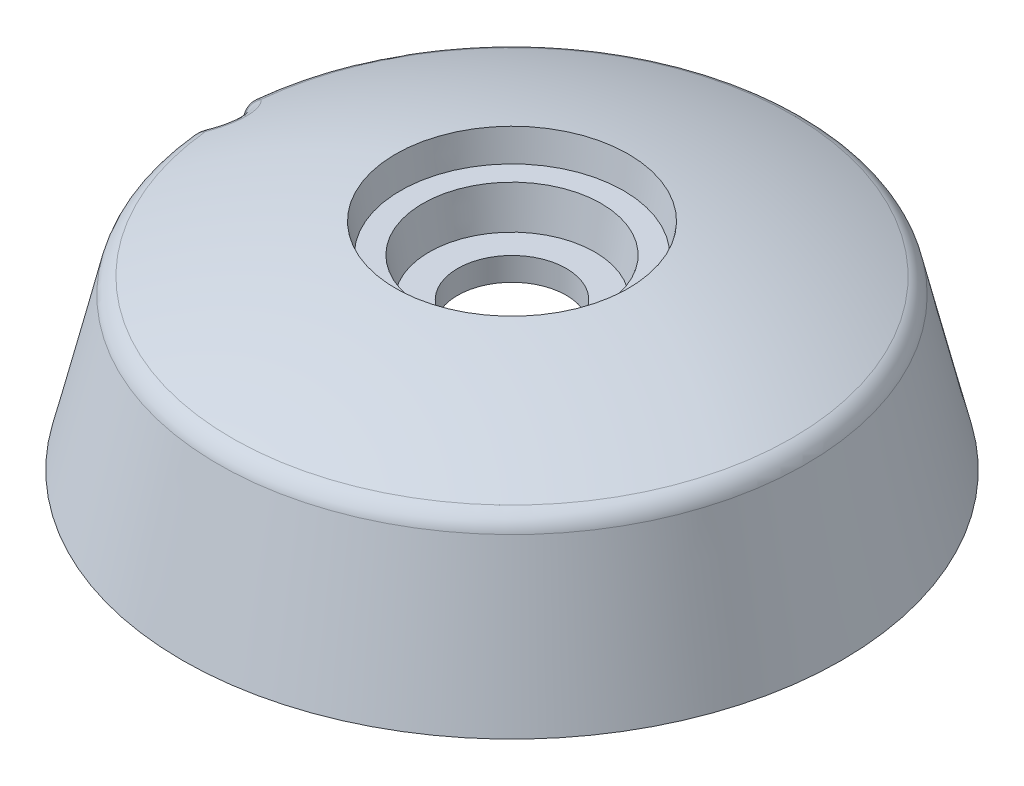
ISO-10303-21;
HEADER;
FILE_DESCRIPTION(('STEP AP214'),'2;1');
FILE_NAME('part.step','',(''),(''),'','','');
FILE_SCHEMA(('AUTOMOTIVE_DESIGN { 1 0 10303 214 1 1 1 1 }'));
ENDSEC;
DATA;
#1=APPLICATION_CONTEXT('core data for automotive mechanical design processes');
#2=APPLICATION_PROTOCOL_DEFINITION('international standard','automotive_design',2000,#1);
#3=PRODUCT_CONTEXT('',#1,'mechanical');
#4=PRODUCT('Part','Part','',(#3));
#5=PRODUCT_RELATED_PRODUCT_CATEGORY('part','',(#4));
#6=PRODUCT_DEFINITION_FORMATION('','',#4);
#7=PRODUCT_DEFINITION_CONTEXT('part definition',#1,'design');
#8=PRODUCT_DEFINITION('design','',#6,#7);
#9=PRODUCT_DEFINITION_SHAPE('','',#8);
#10=(LENGTH_UNIT() NAMED_UNIT(*) SI_UNIT(.MILLI.,.METRE.));
#11=(NAMED_UNIT(*) PLANE_ANGLE_UNIT() SI_UNIT($,.RADIAN.));
#12=(NAMED_UNIT(*) SI_UNIT($,.STERADIAN.) SOLID_ANGLE_UNIT());
#13=UNCERTAINTY_MEASURE_WITH_UNIT(LENGTH_MEASURE(1.E-05),#10,'distance_accuracy_value','');
#14=(GEOMETRIC_REPRESENTATION_CONTEXT(3) GLOBAL_UNCERTAINTY_ASSIGNED_CONTEXT((#13)) GLOBAL_UNIT_ASSIGNED_CONTEXT((#10,
#11,#12)) REPRESENTATION_CONTEXT('',''));
#15=CARTESIAN_POINT('',(0.,0.,0.));
#16=DIRECTION('',(0.,0.,1.));
#17=DIRECTION('',(1.,0.,0.));
#18=AXIS2_PLACEMENT_3D('',#15,#16,#17);
#19=CARTESIAN_POINT('',(0.,0.,0.));
#20=DIRECTION('',(0.,-1.,0.));
#21=DIRECTION('',(0.,0.,-1.));
#22=AXIS2_PLACEMENT_3D('',#19,#20,#21);
#23=CONICAL_SURFACE('',#22,42.5,0.233743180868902);
#24=CARTESIAN_POINT('',(0.,0.,0.));
#25=DIRECTION('',(0.,-1.,0.));
#26=DIRECTION('',(0.,0.,-1.));
#27=AXIS2_PLACEMENT_3D('',#24,#25,#26);
#28=CIRCLE('',#27,42.5);
#29=CARTESIAN_POINT('',(0.,0.,-42.5));
#30=VERTEX_POINT('',#29);
#31=EDGE_CURVE('E359',#30,#30,#28,.T.);
#32=ORIENTED_EDGE('',*,*,#31,.F.);
#33=EDGE_LOOP('',(#32));
#34=FACE_BOUND('',#33,.T.);
#35=CARTESIAN_POINT('',(0.,19.5451697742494,0.));
#36=DIRECTION('',(0.,1.,0.));
#37=DIRECTION('',(0.,0.,1.));
#38=AXIS2_PLACEMENT_3D('',#35,#36,#37);
#39=CIRCLE('',#38,37.8463881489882);
#40=CARTESIAN_POINT('',(-37.6291050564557,19.5451697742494,-4.04963561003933));
#41=VERTEX_POINT('',#40);
#42=CARTESIAN_POINT('',(-37.6291050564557,19.5451697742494,4.04963561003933));
#43=VERTEX_POINT('',#42);
#44=EDGE_CURVE('E99',#41,#43,#39,.F.);
#45=ORIENTED_EDGE('',*,*,#44,.T.);
#46=CARTESIAN_POINT('',(-34.6164243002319,29.1047307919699,2.29848944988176));
#47=CARTESIAN_POINT('',(-35.4149548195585,29.2968030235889,2.98738631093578));
#48=CARTESIAN_POINT('',(-35.298998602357,29.2702717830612,4.05273689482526));
#49=CARTESIAN_POINT('',(-35.3911217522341,25.8626746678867,2.3007570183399));
#50=CARTESIAN_POINT('',(-36.1889818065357,26.0556200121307,2.98763146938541));
#51=CARTESIAN_POINT('',(-36.0760087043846,26.0286331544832,4.05163976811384));
#52=CARTESIAN_POINT('',(-36.1656566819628,22.6205791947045,2.30287678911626));
#53=CARTESIAN_POINT('',(-36.9631487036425,22.813250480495,2.98786320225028));
#54=CARTESIAN_POINT('',(-36.8526946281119,22.7869293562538,4.0506091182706));
#55=CARTESIAN_POINT('',(-37.7144480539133,16.1363209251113,2.30686486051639));
#56=CARTESIAN_POINT('',(-38.5111920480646,16.328698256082,2.9883030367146));
#57=CARTESIAN_POINT('',(-38.405515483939,16.303410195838,4.04866210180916));
#58=CARTESIAN_POINT('',(-38.4887044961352,12.8941581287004,2.30873316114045));
#59=CARTESIAN_POINT('',(-39.2851290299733,13.0862626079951,2.98851116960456));
#60=CARTESIAN_POINT('',(-39.1816504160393,13.0615948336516,4.04774573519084));
#61=CARTESIAN_POINT('',(-39.5832841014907,8.3099308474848,2.31122821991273));
#62=CARTESIAN_POINT('',(-40.3794107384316,8.50112522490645,2.98879120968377));
#63=CARTESIAN_POINT('',(-40.2787293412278,8.4778327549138,4.04651765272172));
#64=CARTESIAN_POINT('',(-39.9037033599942,6.9678895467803,2.31194088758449));
#65=CARTESIAN_POINT('',(-40.6996974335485,7.15902213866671,2.98887145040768));
#66=CARTESIAN_POINT('',(-40.5998612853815,7.13592448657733,4.04616632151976));
#67=CARTESIAN_POINT('',(-40.9981513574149,2.38363052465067,2.31431844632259));
#68=CARTESIAN_POINT('',(-41.7935363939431,2.57525352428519,2.98913991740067));
#69=CARTESIAN_POINT('',(-41.6966831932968,2.55210976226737,4.04499252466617));
#70=CARTESIAN_POINT('',(-41.7720898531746,-0.858608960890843,2.31590288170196));
#71=CARTESIAN_POINT('',(-42.5671983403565,-0.667204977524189,2.98932028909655));
#72=CARTESIAN_POINT('',(-42.4721972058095,-0.689832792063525,4.04420730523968));
#73=CARTESIAN_POINT('',(-42.5459365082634,-4.10087057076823,2.31740612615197));
#74=CARTESIAN_POINT('',(-43.3409308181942,-3.91029882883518,2.98949247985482));
#75=CARTESIAN_POINT('',(-43.2475338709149,-3.93181205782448,4.04346012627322));
#76=(BOUNDED_SURFACE() B_SPLINE_SURFACE(3,2,((#46,#47,#48),(#49,#50,#51),(#52,#53,#54),(#55,#56,
#57),(#58,#59,#60),(#61,#62,#63),(#64,#65,#66),(#67,#68,#69),(#70,#71,#72),(#73,#74,#75)),
.UNSPECIFIED.,.F.,.F.,.F.) B_SPLINE_SURFACE_WITH_KNOTS((4,2,2,2,4),(3,3),(0.,10.0000000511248,
20.0000000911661,24.1392892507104,34.1392892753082),(0.,1.),
.UNSPECIFIED.) GEOMETRIC_REPRESENTATION_ITEM() RATIONAL_B_SPLINE_SURFACE(((1.,0.881380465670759,
1.),(1.,0.881682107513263,1.),(1.,0.881963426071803,1.),(1.,0.882491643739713,1.),(1.,
0.882738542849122,1.),(1.,0.883067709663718,1.),(1.,0.883161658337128,1.),(1.,0.883474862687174,
1.),(1.,0.883683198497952,1.),(1.,0.883880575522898,1.))) REPRESENTATION_ITEM('') SURFACE());
#77=CARTESIAN_POINT('',(-35.298998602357,29.2702717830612,4.05273689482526));
#78=CARTESIAN_POINT('',(-36.0760087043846,26.0286331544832,4.05163976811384));
#79=CARTESIAN_POINT('',(-36.8526946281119,22.7869293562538,4.0506091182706));
#80=CARTESIAN_POINT('',(-38.405515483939,16.303410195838,4.04866210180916));
#81=CARTESIAN_POINT('',(-39.1816504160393,13.0615948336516,4.04774573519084));
#82=CARTESIAN_POINT('',(-40.2787293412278,8.4778327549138,4.04651765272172));
#83=CARTESIAN_POINT('',(-40.5998612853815,7.13592448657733,4.04616632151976));
#84=CARTESIAN_POINT('',(-41.6966831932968,2.55210976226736,4.04499252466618));
#85=CARTESIAN_POINT('',(-42.4721972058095,-0.689832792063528,4.04420730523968));
#86=CARTESIAN_POINT('',(-43.2475338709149,-3.93181205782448,4.04346012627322));
#87=B_SPLINE_CURVE_WITH_KNOTS('',3,(#77,#78,#79,#80,#81,#82,#83,#84,#85,#86),.UNSPECIFIED.,.F.,
.F.,(4,2,2,2,4),(0.,10.0000000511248,20.0000000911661,24.1392892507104,34.1392892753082),.UNSPECIFIED.);
#88=CARTESIAN_POINT('',(-40.9209568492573,5.79400875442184,4.04582269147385));
#89=VERTEX_POINT('',#88);
#90=EDGE_CURVE('E271',#43,#89,#87,.T.);
#91=ORIENTED_EDGE('',*,*,#90,.T.);
#92=CARTESIAN_POINT('',(-40.0475388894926,6.41914088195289,2.17567951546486));
#93=CARTESIAN_POINT('',(-40.7963739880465,6.79961238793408,2.81495657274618));
#94=CARTESIAN_POINT('',(-40.6276329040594,7.11617064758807,3.80768263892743));
#95=CARTESIAN_POINT('',(-40.0606983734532,6.35524457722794,2.19828989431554));
#96=CARTESIAN_POINT('',(-40.8135360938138,6.72039590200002,2.84377823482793));
#97=CARTESIAN_POINT('',(-40.6493995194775,7.00967680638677,3.84713490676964));
#98=CARTESIAN_POINT('',(-40.0742913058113,6.2905030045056,2.21815447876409));
#99=CARTESIAN_POINT('',(-40.8311243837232,6.64018489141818,2.86906827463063));
#100=CARTESIAN_POINT('',(-40.671908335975,6.90177418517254,3.88177662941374));
#101=CARTESIAN_POINT('',(-40.1022864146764,6.15974193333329,2.2523051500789));
#102=CARTESIAN_POINT('',(-40.8670827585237,6.47819859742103,2.91251552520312));
#103=CARTESIAN_POINT('',(-40.718317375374,6.68383906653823,3.94129040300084));
#104=CARTESIAN_POINT('',(-40.1166885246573,6.09372254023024,2.26659169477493));
#105=CARTESIAN_POINT('',(-40.8854509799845,6.3964322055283,2.93066843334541));
#106=CARTESIAN_POINT('',(-40.7422174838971,6.57380674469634,3.96616325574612));
#107=CARTESIAN_POINT('',(-40.1609858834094,5.89452864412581,2.3009281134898));
#108=CARTESIAN_POINT('',(-40.9415639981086,6.14968373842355,2.97426730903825));
#109=CARTESIAN_POINT('',(-40.8158050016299,6.24181691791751,4.02586081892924));
#110=CARTESIAN_POINT('',(-40.1920077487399,5.76004492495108,2.31251582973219));
#111=CARTESIAN_POINT('',(-40.9803384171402,5.98315040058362,2.98890289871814));
#112=CARTESIAN_POINT('',(-40.8674384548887,6.01767738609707,4.04587105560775));
#113=CARTESIAN_POINT('',(-40.2561404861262,5.49189211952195,2.31275778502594));
#114=CARTESIAN_POINT('',(-41.0595852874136,5.65073675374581,2.9889971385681));
#115=CARTESIAN_POINT('',(-40.974375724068,5.57075604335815,4.04577441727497));
#116=CARTESIAN_POINT('',(-40.2892473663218,5.35822198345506,2.30145462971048));
#117=CARTESIAN_POINT('',(-41.1000342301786,5.48494009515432,2.97451189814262));
#118=CARTESIAN_POINT('',(-41.0296725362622,5.34797248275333,4.02574207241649));
#119=CARTESIAN_POINT('',(-40.3565875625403,5.09504976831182,2.25624344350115));
#120=CARTESIAN_POINT('',(-41.1815852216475,5.15793509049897,2.91669441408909));
#121=CARTESIAN_POINT('',(-41.1423161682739,4.90935212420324,3.94616403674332));
#122=CARTESIAN_POINT('',(-40.3908206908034,4.96554700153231,2.22233916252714));
#123=CARTESIAN_POINT('',(-41.2226678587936,4.99679940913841,2.87339630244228));
#124=CARTESIAN_POINT('',(-41.1996626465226,4.69351418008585,3.8866249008));
#125=CARTESIAN_POINT('',(-40.4591977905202,4.7142141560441,2.1326070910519));
#126=CARTESIAN_POINT('',(-41.304198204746,4.683361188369,2.75863932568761));
#127=CARTESIAN_POINT('',(-41.3143462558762,4.27462610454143,3.72925093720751));
#128=CARTESIAN_POINT('',(-40.493341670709,4.59239019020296,2.07676208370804));
#129=CARTESIAN_POINT('',(-41.3446308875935,4.53111523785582,2.68720696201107));
#130=CARTESIAN_POINT('',(-41.371683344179,4.0715861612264,3.63138603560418));
#131=CARTESIAN_POINT('',(-40.5600952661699,4.36002551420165,1.94441652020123));
#132=CARTESIAN_POINT('',(-41.423329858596,4.23999212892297,2.51757285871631));
#133=CARTESIAN_POINT('',(-41.4838906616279,3.6843117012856,3.39959859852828));
#134=CARTESIAN_POINT('',(-40.5927048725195,4.24948560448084,1.86791450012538));
#135=CARTESIAN_POINT('',(-41.4615893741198,4.10113358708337,2.41942350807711));
#136=CARTESIAN_POINT('',(-41.5387607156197,3.50007851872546,3.26567350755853));
#137=CARTESIAN_POINT('',(-40.6544970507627,4.04425403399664,1.6971449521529));
#138=CARTESIAN_POINT('',(-41.5338812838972,3.84268799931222,2.1998506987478));
#139=CARTESIAN_POINT('',(-41.6428130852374,3.15802590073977,2.96683326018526));
#140=CARTESIAN_POINT('',(-40.6837147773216,3.94939445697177,1.60309225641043));
#141=CARTESIAN_POINT('',(-41.5679592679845,3.72288455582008,2.07875251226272));
#142=CARTESIAN_POINT('',(-41.6920536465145,2.99992660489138,2.80229291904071));
#143=CARTESIAN_POINT('',(-40.7376618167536,3.77700184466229,1.39914854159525));
#144=CARTESIAN_POINT('',(-41.6307710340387,3.50470237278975,1.81563973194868));
#145=CARTESIAN_POINT('',(-41.7830211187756,2.71260558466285,2.44559204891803));
#146=CARTESIAN_POINT('',(-40.7623921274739,3.69946495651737,1.28926105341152));
#147=CARTESIAN_POINT('',(-41.6595162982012,3.40627910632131,1.67364730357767));
#148=CARTESIAN_POINT('',(-41.8247497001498,2.58337743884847,2.25343767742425));
#149=CARTESIAN_POINT('',(-40.8052505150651,3.56661631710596,1.06077506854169));
#150=CARTESIAN_POINT('',(-41.7092811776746,3.23738194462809,1.37792887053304));
#151=CARTESIAN_POINT('',(-41.8970943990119,2.36196303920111,1.85396371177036));
#152=CARTESIAN_POINT('',(-40.823575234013,3.51063594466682,0.942602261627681));
#153=CARTESIAN_POINT('',(-41.7305436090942,3.16602395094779,1.22476009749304));
#154=CARTESIAN_POINT('',(-41.9280413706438,2.26866241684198,1.64738620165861));
#155=CARTESIAN_POINT('',(-40.8537434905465,3.41910554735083,0.697817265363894));
#156=CARTESIAN_POINT('',(-41.7655246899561,3.04925559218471,0.907157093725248));
#157=CARTESIAN_POINT('',(-41.9790012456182,2.11611175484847,1.21952293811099));
#158=CARTESIAN_POINT('',(-40.8655883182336,3.38355145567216,0.571206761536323));
#159=CARTESIAN_POINT('',(-41.7792576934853,3.00379647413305,0.742679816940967));
#160=CARTESIAN_POINT('',(-41.9990163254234,2.05685493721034,0.998240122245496));
#161=CARTESIAN_POINT('',(-40.8818444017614,3.33488658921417,0.317526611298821));
#162=CARTESIAN_POINT('',(-41.7980957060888,2.94157033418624,0.412980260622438));
#163=CARTESIAN_POINT('',(-42.0264877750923,1.97574682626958,0.55489566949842));
#164=CARTESIAN_POINT('',(-40.8864822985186,3.32109132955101,0.190602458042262));
#165=CARTESIAN_POINT('',(-41.8034713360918,2.92390323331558,0.247890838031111));
#166=CARTESIAN_POINT('',(-42.0343270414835,1.9527547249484,0.333087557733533));
#167=CARTESIAN_POINT('',(-40.8887861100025,3.31422956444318,-0.0638603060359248));
#168=CARTESIAN_POINT('',(-41.8061405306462,2.91512159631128,-0.0830450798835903));
#169=CARTESIAN_POINT('',(-42.0382209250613,1.94131844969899,-0.111599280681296));
#170=CARTESIAN_POINT('',(-40.8864528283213,3.32116066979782,-0.191398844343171));
#171=CARTESIAN_POINT('',(-41.8034361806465,2.92400020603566,-0.248963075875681));
#172=CARTESIAN_POINT('',(-42.0342769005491,1.9528702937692,-0.334477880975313));
#173=CARTESIAN_POINT('',(-40.875031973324,3.35526401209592,-0.441491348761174));
#174=CARTESIAN_POINT('',(-41.7902028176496,2.96762574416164,-0.574104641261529));
#175=CARTESIAN_POINT('',(-42.0149750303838,2.00970919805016,-0.771539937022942));
#176=CARTESIAN_POINT('',(-40.8660449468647,3.38213494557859,-0.564091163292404));
#177=CARTESIAN_POINT('',(-41.7797848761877,3.00200545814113,-0.733456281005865));
#178=CARTESIAN_POINT('',(-41.9997870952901,2.05449408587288,-0.985803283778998));
#179=CARTESIAN_POINT('',(-40.8419200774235,3.45490073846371,-0.802847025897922));
#180=CARTESIAN_POINT('',(-41.7518193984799,3.09492764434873,-1.04346179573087));
#181=CARTESIAN_POINT('',(-41.9590278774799,2.17577040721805,-1.40310034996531));
#182=CARTESIAN_POINT('',(-40.8267820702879,3.5007961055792,-0.919002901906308));
#183=CARTESIAN_POINT('',(-41.7342616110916,3.15350453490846,-1.19416319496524));
#184=CARTESIAN_POINT('',(-41.9334563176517,2.25226268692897,-1.60613376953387));
#185=CARTESIAN_POINT('',(-40.7909600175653,3.61074561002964,-1.14282953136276));
#186=CARTESIAN_POINT('',(-41.6926963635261,3.29350474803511,-1.48417216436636));
#187=CARTESIAN_POINT('',(-41.8729690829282,2.43551186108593,-1.99741595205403));
#188=CARTESIAN_POINT('',(-40.7702272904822,3.67495943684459,-1.25041452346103));
#189=CARTESIAN_POINT('',(-41.6686203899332,3.37517017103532,-1.62338844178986));
#190=CARTESIAN_POINT('',(-41.8379713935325,2.54253490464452,-2.18551523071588));
#191=CARTESIAN_POINT('',(-40.7358253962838,3.78321254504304,-1.4023427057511));
#192=CARTESIAN_POINT('',(-41.6286376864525,3.51243949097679,-1.81963922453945));
#193=CARTESIAN_POINT('',(-41.7799307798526,2.72295675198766,-2.45118790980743));
#194=CARTESIAN_POINT('',(-40.7238045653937,3.82129551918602,-1.45142049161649));
#195=CARTESIAN_POINT('',(-41.6146536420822,3.56069859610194,-1.88300348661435));
#196=CARTESIAN_POINT('',(-41.7596547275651,2.78642837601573,-2.53701682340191));
#197=CARTESIAN_POINT('',(-40.6987867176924,3.90121969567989,-1.54622294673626));
#198=CARTESIAN_POINT('',(-41.5855255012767,3.6618561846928,-2.00531284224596));
#199=CARTESIAN_POINT('',(-41.7174683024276,2.91963533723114,-2.70282729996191));
#200=CARTESIAN_POINT('',(-40.6857888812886,3.94306405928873,-1.59194473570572));
#201=CARTESIAN_POINT('',(-41.5703794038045,3.71476253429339,-2.06425239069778));
#202=CARTESIAN_POINT('',(-41.6955565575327,2.98937594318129,-2.78280383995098));
#203=CARTESIAN_POINT('',(-40.6448291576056,4.07615162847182,-1.7259819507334));
#204=CARTESIAN_POINT('',(-41.5225827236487,3.88287739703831,-2.2369679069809));
#205=CARTESIAN_POINT('',(-41.6265293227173,3.21118855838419,-3.01728956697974));
#206=CARTESIAN_POINT('',(-40.615525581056,4.17300398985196,-1.80843730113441));
#207=CARTESIAN_POINT('',(-41.4883275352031,4.00491281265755,-2.34297221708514));
#208=CARTESIAN_POINT('',(-41.577175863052,3.37260916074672,-3.16157766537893));
#209=CARTESIAN_POINT('',(-40.5547402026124,4.37859314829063,-1.95587838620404));
#210=CARTESIAN_POINT('',(-41.4170187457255,4.2632631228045,-2.53229518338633));
#211=CARTESIAN_POINT('',(-41.4748879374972,3.71525775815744,-3.41966827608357));
#212=CARTESIAN_POINT('',(-40.5232578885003,4.48733274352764,-2.02085999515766));
#213=CARTESIAN_POINT('',(-41.3799654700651,4.3995832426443,-2.61556640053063));
#214=CARTESIAN_POINT('',(-41.421952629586,3.89649041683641,-3.53346358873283));
#215=CARTESIAN_POINT('',(-40.4747990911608,4.65911909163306,-2.10516912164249));
#216=CARTESIAN_POINT('',(-41.3226490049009,4.61438839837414,-2.72349974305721));
#217=CARTESIAN_POINT('',(-41.3405560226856,4.18280099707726,-3.68117863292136));
#218=CARTESIAN_POINT('',(-40.4581392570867,4.71894801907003,-2.13141116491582));
#219=CARTESIAN_POINT('',(-41.3028882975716,4.68913059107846,-2.75707884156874));
#220=CARTESIAN_POINT('',(-41.3125869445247,4.28251587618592,-3.727171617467));
#221=CARTESIAN_POINT('',(-40.4247528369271,4.84053841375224,-2.17868982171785));
#222=CARTESIAN_POINT('',(-41.2631630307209,4.84087019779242,-2.81755766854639));
#223=CARTESIAN_POINT('',(-41.2565689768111,4.48516653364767,-3.81006559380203));
#224=CARTESIAN_POINT('',(-40.4080263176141,4.90229823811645,-2.19973073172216));
#225=CARTESIAN_POINT('',(-41.2432001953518,4.91786054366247,-2.84445705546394));
#226=CARTESIAN_POINT('',(-41.2285201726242,4.58809957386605,-3.84697408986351));
#227=CARTESIAN_POINT('',(-40.3579903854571,5.08982804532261,-2.25485294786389));
#228=CARTESIAN_POINT('',(-41.1832508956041,5.15146470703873,-2.91494061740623));
#229=CARTESIAN_POINT('',(-41.1446679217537,4.90064925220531,-3.9437210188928));
#230=CARTESIAN_POINT('',(-40.3247580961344,5.21808290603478,-2.2810483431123));
#231=CARTESIAN_POINT('',(-41.1431611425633,5.31086831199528,-2.94839848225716));
#232=CARTESIAN_POINT('',(-41.0890469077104,5.11440735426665,-3.98978170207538));
#233=CARTESIAN_POINT('',(-40.2806992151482,5.39373716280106,-2.30184078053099));
#234=CARTESIAN_POINT('',(-41.089510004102,5.52891138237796,-2.97501761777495));
#235=CARTESIAN_POINT('',(-41.0154144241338,5.40716444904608,-4.02648829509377));
#236=CARTESIAN_POINT('',(-40.2692192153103,5.44004354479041,-2.30592369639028));
#237=CARTESIAN_POINT('',(-41.0754818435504,5.5863709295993,-2.98025394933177));
#238=CARTESIAN_POINT('',(-40.9962391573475,5.48434175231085,-4.03371958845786));
#239=CARTESIAN_POINT('',(-40.2464863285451,5.5328291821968,-2.31134192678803));
#240=CARTESIAN_POINT('',(-41.0476025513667,5.70146554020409,-2.98722734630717));
#241=CARTESIAN_POINT('',(-40.9582892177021,5.63898448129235,-4.04337694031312));
#242=CARTESIAN_POINT('',(-40.2352332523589,5.5793082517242,-2.31267963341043));
#243=CARTESIAN_POINT('',(-41.0337521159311,5.75909701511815,-2.98896696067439));
#244=CARTESIAN_POINT('',(-40.9395142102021,5.71644959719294,-4.0458071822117));
#245=CARTESIAN_POINT('',(-40.192136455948,5.75951114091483,-2.31251423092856));
#246=CARTESIAN_POINT('',(-40.9804971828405,5.98248759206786,-2.98890152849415));
#247=CARTESIAN_POINT('',(-40.8676531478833,6.01678774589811,-4.04586723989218));
#248=CARTESIAN_POINT('',(-40.1611902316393,5.89364407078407,-2.30100233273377));
#249=CARTESIAN_POINT('',(-40.9418193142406,6.14858818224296,-2.97436116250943));
#250=CARTESIAN_POINT('',(-40.8161451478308,6.24034262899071,-4.02598894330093));
#251=CARTESIAN_POINT('',(-40.1169142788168,6.09269020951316,-2.26680864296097));
#252=CARTESIAN_POINT('',(-40.8857386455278,6.39515366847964,-2.93094400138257));
#253=CARTESIAN_POINT('',(-40.7425921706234,6.5720861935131,-3.96654089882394));
#254=CARTESIAN_POINT('',(-40.1024597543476,6.15893892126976,-2.25249874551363));
#255=CARTESIAN_POINT('',(-40.8673047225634,6.47720389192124,-2.91276167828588));
#256=CARTESIAN_POINT('',(-40.7186048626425,6.6825007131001,-3.94162764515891));
#257=CARTESIAN_POINT('',(-40.0743726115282,6.29011666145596,-2.21827132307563));
#258=CARTESIAN_POINT('',(-40.8312295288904,6.63970607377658,-2.86921709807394));
#259=CARTESIAN_POINT('',(-40.6720429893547,6.90113028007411,-3.88198038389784));
#260=CARTESIAN_POINT('',(-40.0607396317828,6.35504626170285,-2.19835628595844));
#261=CARTESIAN_POINT('',(-40.8135897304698,6.72014986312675,-2.84386295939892));
#262=CARTESIAN_POINT('',(-40.6494678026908,7.00934628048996,-3.84725073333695));
#263=CARTESIAN_POINT('',(-40.0475388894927,6.41914088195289,-2.17567951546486));
#264=CARTESIAN_POINT('',(-40.7963739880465,6.79961238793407,-2.81495657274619));
#265=CARTESIAN_POINT('',(-40.6276329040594,7.11617064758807,-3.80768263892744));
#266=(BOUNDED_SURFACE() B_SPLINE_SURFACE(3,2,((#92,#93,#94),(#95,#96,#97),(#98,#99,#100),(#101,
#102,#103),(#104,#105,#106),(#107,#108,#109),(#110,#111,#112),(#113,#114,#115),(#116,#117,#118),
(#119,#120,#121),(#122,#123,#124),(#125,#126,#127),(#128,#129,#130),(#131,#132,#133),(#134,#135,
#136),(#137,#138,#139),(#140,#141,#142),(#143,#144,#145),(#146,#147,#148),(#149,#150,#151),
(#152,#153,#154),(#155,#156,#157),(#158,#159,#160),(#161,#162,#163),(#164,#165,#166),(#167,#168,
#169),(#170,#171,#172),(#173,#174,#175),(#176,#177,#178),(#179,#180,#181),(#182,#183,#184),
(#185,#186,#187),(#188,#189,#190),(#191,#192,#193),(#194,#195,#196),(#197,#198,#199),(#200,#201,
#202),(#203,#204,#205),(#206,#207,#208),(#209,#210,#211),(#212,#213,#214),(#215,#216,#217),
(#218,#219,#220),(#221,#222,#223),(#224,#225,#226),(#227,#228,#229),(#230,#231,#232),(#233,#234,
#235),(#236,#237,#238),(#239,#240,#241),(#242,#243,#244),(#245,#246,#247),(#248,#249,#250),
(#251,#252,#253),(#254,#255,#256),(#257,#258,#259),(#260,#261,#262),(#263,#264,#265)),
.UNSPECIFIED.,.F.,.F.,.F.) B_SPLINE_SURFACE_WITH_KNOTS((4,2,2,2,2,2,2,2,2,2,2,2,2,2,2,2,2,2,2,2,
2,2,2,2,2,2,2,2,4),(3,3),(0.,0.345008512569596,0.689988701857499,1.3790240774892,
2.06677816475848,2.75441817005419,3.44259884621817,4.13082830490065,4.81112862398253,
5.49127748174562,6.14819692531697,6.80498553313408,7.44066875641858,8.07627870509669,
8.70247489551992,9.32868779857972,9.96053582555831,10.2766015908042,10.5929355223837,
11.2424541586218,11.8921260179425,12.228887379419,12.5653696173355,13.2370024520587,
13.4763266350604,13.7154421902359,14.4022717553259,14.7484485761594,15.094471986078),(0.,1.),
.UNSPECIFIED.) GEOMETRIC_REPRESENTATION_ITEM() RATIONAL_B_SPLINE_SURFACE(((1.,0.884385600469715,
1.),(1.,0.884188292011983,1.),(1.,0.884014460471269,1.),(1.,0.883717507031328,1.),(1.,
0.883594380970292,1.),(1.,0.883306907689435,1.),(1.,0.883223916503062,1.),(1.,0.883282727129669,
1.),(1.,0.883424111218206,1.),(1.,0.883912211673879,1.),(1.,0.884258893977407,1.),(1.,
0.885117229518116,1.),(1.,0.885629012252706,1.),(1.,0.886758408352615,1.),(1.,0.887376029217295,
1.),(1.,0.888638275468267,1.),(1.,0.889282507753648,1.),(1.,0.890530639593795,1.),(1.,
0.891134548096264,1.),(1.,0.8922130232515,1.),(1.,0.892691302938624,1.),(1.,0.893491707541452,
1.),(1.,0.893813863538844,1.),(1.,0.894258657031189,1.),(1.,0.894387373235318,1.),(1.,
0.894451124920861,1.),(1.,0.89438618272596,1.),(1.,0.894071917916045,1.),(1.,0.893825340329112,
1.),(1.,0.893176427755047,1.),(1.,0.892774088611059,1.),(1.,0.891849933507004,1.),(1.,
0.891327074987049,1.),(1.,0.890495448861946,1.),(1.,0.890210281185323,1.),(1.,0.889630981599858,
1.),(1.,0.889336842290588,1.),(1.,0.888436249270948,1.),(1.,0.887827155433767,1.),(1.,
0.886666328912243,1.),(1.,0.886114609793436,1.),(1.,0.885363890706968,1.),(1.,0.885122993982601,
1.),(1.,0.884678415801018,1.),(1.,0.884474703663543,1.),(1.,0.883928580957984,1.),(1.,
0.883650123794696,1.),(1.,0.88341074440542,1.),(1.,0.883360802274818,1.),(1.,0.883287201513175,
1.),(1.,0.883263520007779,1.),(1.,0.883224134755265,1.),(1.,0.883306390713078,1.),(1.,
0.883592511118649,1.),(1.,0.883715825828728,1.),(1.,0.884013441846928,1.),(1.,0.884187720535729,
1.),(1.,0.884385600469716,1.))) REPRESENTATION_ITEM('') SURFACE());
#267=CARTESIAN_POINT('',(-40.6276329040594,7.11617064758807,3.80768263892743));
#268=CARTESIAN_POINT('',(-40.6493995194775,7.00967680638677,3.84713490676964));
#269=CARTESIAN_POINT('',(-40.671908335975,6.90177418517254,3.88177662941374));
#270=CARTESIAN_POINT('',(-40.718317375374,6.68383906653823,3.94129040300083));
#271=CARTESIAN_POINT('',(-40.7422174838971,6.57380674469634,3.96616325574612));
#272=CARTESIAN_POINT('',(-40.8158050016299,6.24181691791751,4.02586081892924));
#273=CARTESIAN_POINT('',(-40.8674384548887,6.01767738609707,4.04587105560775));
#274=CARTESIAN_POINT('',(-40.974375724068,5.57075604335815,4.04577441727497));
#275=CARTESIAN_POINT('',(-41.0296725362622,5.34797248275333,4.02574207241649));
#276=CARTESIAN_POINT('',(-41.1423161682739,4.90935212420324,3.94616403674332));
#277=CARTESIAN_POINT('',(-41.1996626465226,4.69351418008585,3.8866249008));
#278=CARTESIAN_POINT('',(-41.3143462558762,4.27462610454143,3.72925093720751));
#279=CARTESIAN_POINT('',(-41.371683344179,4.0715861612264,3.63138603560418));
#280=CARTESIAN_POINT('',(-41.4838906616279,3.68431170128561,3.39959859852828));
#281=CARTESIAN_POINT('',(-41.5387607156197,3.50007851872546,3.26567350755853));
#282=CARTESIAN_POINT('',(-41.6428130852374,3.15802590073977,2.96683326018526));
#283=CARTESIAN_POINT('',(-41.6920536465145,2.99992660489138,2.80229291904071));
#284=CARTESIAN_POINT('',(-41.7830211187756,2.71260558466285,2.44559204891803));
#285=CARTESIAN_POINT('',(-41.8247497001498,2.58337743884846,2.25343767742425));
#286=CARTESIAN_POINT('',(-41.8970943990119,2.36196303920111,1.85396371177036));
#287=CARTESIAN_POINT('',(-41.9280413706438,2.26866241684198,1.64738620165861));
#288=CARTESIAN_POINT('',(-41.9790012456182,2.11611175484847,1.21952293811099));
#289=CARTESIAN_POINT('',(-41.9990163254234,2.05685493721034,0.998240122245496));
#290=CARTESIAN_POINT('',(-42.0264877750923,1.97574682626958,0.55489566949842));
#291=CARTESIAN_POINT('',(-42.0343270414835,1.9527547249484,0.333087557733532));
#292=CARTESIAN_POINT('',(-42.0382209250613,1.94131844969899,-0.111599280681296));
#293=CARTESIAN_POINT('',(-42.0342769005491,1.9528702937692,-0.334477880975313));
#294=CARTESIAN_POINT('',(-42.0149750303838,2.00970919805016,-0.771539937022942));
#295=CARTESIAN_POINT('',(-41.9997870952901,2.05449408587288,-0.985803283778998));
#296=CARTESIAN_POINT('',(-41.9590278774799,2.17577040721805,-1.40310034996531));
#297=CARTESIAN_POINT('',(-41.9334563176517,2.25226268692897,-1.60613376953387));
#298=CARTESIAN_POINT('',(-41.8729690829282,2.43551186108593,-1.99741595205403));
#299=CARTESIAN_POINT('',(-41.8379713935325,2.54253490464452,-2.18551523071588));
#300=CARTESIAN_POINT('',(-41.7799307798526,2.72295675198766,-2.45118790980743));
#301=CARTESIAN_POINT('',(-41.7596547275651,2.78642837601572,-2.53701682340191));
#302=CARTESIAN_POINT('',(-41.7174683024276,2.91963533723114,-2.70282729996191));
#303=CARTESIAN_POINT('',(-41.6955565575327,2.98937594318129,-2.78280383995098));
#304=CARTESIAN_POINT('',(-41.6265293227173,3.21118855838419,-3.01728956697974));
#305=CARTESIAN_POINT('',(-41.5771758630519,3.37260916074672,-3.16157766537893));
#306=CARTESIAN_POINT('',(-41.4748879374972,3.71525775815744,-3.41966827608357));
#307=CARTESIAN_POINT('',(-41.421952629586,3.8964904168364,-3.53346358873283));
#308=CARTESIAN_POINT('',(-41.3405560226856,4.18280099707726,-3.68117863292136));
#309=CARTESIAN_POINT('',(-41.3125869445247,4.28251587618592,-3.72717161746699));
#310=CARTESIAN_POINT('',(-41.2565689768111,4.48516653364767,-3.81006559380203));
#311=CARTESIAN_POINT('',(-41.2285201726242,4.58809957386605,-3.84697408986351));
#312=CARTESIAN_POINT('',(-41.1446679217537,4.90064925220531,-3.9437210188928));
#313=CARTESIAN_POINT('',(-41.0890469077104,5.11440735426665,-3.98978170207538));
#314=CARTESIAN_POINT('',(-41.0154144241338,5.40716444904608,-4.02648829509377));
#315=CARTESIAN_POINT('',(-40.9962391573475,5.48434175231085,-4.03371958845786));
#316=CARTESIAN_POINT('',(-40.9582892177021,5.63898448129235,-4.04337694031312));
#317=CARTESIAN_POINT('',(-40.9395142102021,5.71644959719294,-4.0458071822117));
#318=CARTESIAN_POINT('',(-40.8676531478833,6.01678774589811,-4.04586723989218));
#319=CARTESIAN_POINT('',(-40.8161451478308,6.24034262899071,-4.02598894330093));
#320=CARTESIAN_POINT('',(-40.7425921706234,6.57208619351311,-3.96654089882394));
#321=CARTESIAN_POINT('',(-40.7186048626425,6.6825007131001,-3.94162764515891));
#322=CARTESIAN_POINT('',(-40.6720429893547,6.90113028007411,-3.88198038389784));
#323=CARTESIAN_POINT('',(-40.6494678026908,7.00934628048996,-3.84725073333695));
#324=CARTESIAN_POINT('',(-40.6276329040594,7.11617064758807,-3.80768263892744));
#325=B_SPLINE_CURVE_WITH_KNOTS('',3,(#267,#268,#269,#270,#271,#272,#273,#274,#275,#276,#277,
#278,#279,#280,#281,#282,#283,#284,#285,#286,#287,#288,#289,#290,#291,#292,#293,#294,#295,#296,
#297,#298,#299,#300,#301,#302,#303,#304,#305,#306,#307,#308,#309,#310,#311,#312,#313,#314,#315,
#316,#317,#318,#319,#320,#321,#322,#323,#324),.UNSPECIFIED.,.F.,.F.,(4,2,2,2,2,2,2,2,2,2,2,2,2,
2,2,2,2,2,2,2,2,2,2,2,2,2,2,2,4),(0.,0.345008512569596,0.689988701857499,1.3790240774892,
2.06677816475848,2.75441817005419,3.44259884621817,4.13082830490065,4.81112862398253,
5.49127748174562,6.14819692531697,6.80498553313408,7.44066875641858,8.07627870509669,
8.70247489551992,9.32868779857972,9.96053582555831,10.2766015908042,10.5929355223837,
11.2424541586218,11.8921260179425,12.228887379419,12.5653696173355,13.2370024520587,
13.4763266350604,13.7154421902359,14.4022717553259,14.7484485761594,15.094471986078),.UNSPECIFIED.);
#326=CARTESIAN_POINT('',(-40.9209568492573,5.79400875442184,-4.04582269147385));
#327=VERTEX_POINT('',#326);
#328=EDGE_CURVE('E101',#89,#327,#325,.T.);
#329=ORIENTED_EDGE('',*,*,#328,.T.);
#330=CARTESIAN_POINT('',(-42.5459365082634,-4.10087057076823,-2.31740612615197));
#331=CARTESIAN_POINT('',(-43.3409308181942,-3.91029882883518,-2.98949247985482));
#332=CARTESIAN_POINT('',(-43.2475338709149,-3.93181205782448,-4.04346012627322));
#333=CARTESIAN_POINT('',(-41.7720886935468,-0.85860925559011,-2.31590173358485));
#334=CARTESIAN_POINT('',(-42.5672050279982,-0.667237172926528,-2.98932022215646));
#335=CARTESIAN_POINT('',(-42.4721946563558,-0.689833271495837,-4.04420775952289));
#336=CARTESIAN_POINT('',(-40.998150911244,2.38363041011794,-2.31431800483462));
#337=CARTESIAN_POINT('',(-41.7935389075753,2.57524138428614,-2.98913989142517));
#338=CARTESIAN_POINT('',(-41.6966822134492,2.55210957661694,-4.04499269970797));
#339=CARTESIAN_POINT('',(-39.4500570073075,8.86805708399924,-2.31095583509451));
#340=CARTESIAN_POINT('',(-40.2460732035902,9.05995119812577,-2.98876014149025));
#341=CARTESIAN_POINT('',(-40.1452314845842,9.03590793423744,-4.04665268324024));
#342=CARTESIAN_POINT('',(-38.6759008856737,12.1102440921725,-2.3091773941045));
#343=CARTESIAN_POINT('',(-39.4722272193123,12.3023764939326,-2.98856070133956));
#344=CARTESIAN_POINT('',(-39.3692931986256,12.2777634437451,-4.04752772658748));
#345=CARTESIAN_POINT('',(-37.5811176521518,16.6944222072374,-2.30649967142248));
#346=CARTESIAN_POINT('',(-38.3781267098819,16.8860021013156,-2.98826319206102));
#347=CARTESIAN_POINT('',(-38.27181444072,16.8614440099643,-4.04883962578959));
#348=CARTESIAN_POINT('',(-37.2605969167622,18.0364390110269,-2.3056959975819));
#349=CARTESIAN_POINT('',(-38.0577534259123,18.2280928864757,-2.98817419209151));
#350=CARTESIAN_POINT('',(-37.9504833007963,18.2033116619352,-4.04923273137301));
#351=CARTESIAN_POINT('',(-36.1656572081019,22.6205793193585,-2.3028773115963));
#352=CARTESIAN_POINT('',(-36.9631461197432,22.8132631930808,-2.98786323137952));
#353=CARTESIAN_POINT('',(-36.8526957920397,22.7869295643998,-4.05060891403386));
#354=CARTESIAN_POINT('',(-35.3911230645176,25.8626749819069,-2.30075832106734));
#355=CARTESIAN_POINT('',(-36.1889755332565,26.0556510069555,-2.98763154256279));
#356=CARTESIAN_POINT('',(-36.0760116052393,26.0286336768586,-4.05163925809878));
#357=CARTESIAN_POINT('',(-34.6164243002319,29.1047307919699,-2.29848944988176));
#358=CARTESIAN_POINT('',(-35.4149548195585,29.2968030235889,-2.98738631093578));
#359=CARTESIAN_POINT('',(-35.298998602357,29.2702717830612,-4.05273689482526));
#360=(BOUNDED_SURFACE() B_SPLINE_SURFACE(3,2,((#330,#331,#332),(#333,#334,#335),(#336,#337,
#338),(#339,#340,#341),(#342,#343,#344),(#345,#346,#347),(#348,#349,#350),(#351,#352,#353),
(#354,#355,#356),(#357,#358,#359)),.UNSPECIFIED.,.F.,.F.,.F.) B_SPLINE_SURFACE_WITH_KNOTS((4,2,
2,2,4),(3,3),(0.,10.0000000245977,20.0000000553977,24.1392892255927,34.1392892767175),(0.,1.),
.UNSPECIFIED.) GEOMETRIC_REPRESENTATION_ITEM() RATIONAL_B_SPLINE_SURFACE(((1.,0.883880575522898,
1.),(1.,0.883683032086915,1.),(1.,0.883474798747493,1.),(1.,0.883031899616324,1.),(1.,
0.88279723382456,1.),(1.,0.882443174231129,1.),(1.,0.882336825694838,1.),(1.,0.881963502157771,
1.),(1.,0.881682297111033,1.),(1.,0.881380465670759,1.))) REPRESENTATION_ITEM('') SURFACE());
#361=CARTESIAN_POINT('',(-43.2475338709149,-3.93181205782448,-4.04346012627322));
#362=CARTESIAN_POINT('',(-42.4721946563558,-0.689833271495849,-4.04420775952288));
#363=CARTESIAN_POINT('',(-41.6966822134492,2.55210957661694,-4.04499269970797));
#364=CARTESIAN_POINT('',(-40.1452314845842,9.03590793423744,-4.04665268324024));
#365=CARTESIAN_POINT('',(-39.3692931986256,12.2777634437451,-4.04752772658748));
#366=CARTESIAN_POINT('',(-38.27181444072,16.8614440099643,-4.04883962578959));
#367=CARTESIAN_POINT('',(-37.9504833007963,18.2033116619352,-4.04923273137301));
#368=CARTESIAN_POINT('',(-36.8526957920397,22.7869295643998,-4.05060891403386));
#369=CARTESIAN_POINT('',(-36.0760116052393,26.0286336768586,-4.05163925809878));
#370=CARTESIAN_POINT('',(-35.298998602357,29.2702717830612,-4.05273689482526));
#371=B_SPLINE_CURVE_WITH_KNOTS('',3,(#361,#362,#363,#364,#365,#366,#367,#368,#369,#370),
.UNSPECIFIED.,.F.,.F.,(4,2,2,2,4),(0.,10.0000000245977,20.0000000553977,24.1392892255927,
34.1392892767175),.UNSPECIFIED.);
#372=EDGE_CURVE('E100',#327,#41,#371,.T.);
#373=ORIENTED_EDGE('',*,*,#372,.T.);
#374=EDGE_LOOP('',(#45,#91,#329,#373));
#375=FACE_BOUND('',#374,.T.);
#376=ADVANCED_FACE('F41',(#34,#375),#23,.T.);
#377=CARTESIAN_POINT('',(0.,-62.890625,0.));
#378=DIRECTION('',(0.,-1.,0.));
#379=DIRECTION('',(-1.,0.,0.));
#380=AXIS2_PLACEMENT_3D('',#377,#378,#379);
#381=SPHERICAL_SURFACE('',#380,91.890625);
#382=CARTESIAN_POINT('',(0.,27.7674522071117,0.));
#383=DIRECTION('',(0.,-1.,0.));
#384=DIRECTION('',(0.,0.,-1.));
#385=AXIS2_PLACEMENT_3D('',#382,#383,#384);
#386=CIRCLE('',#385,15.);
#387=CARTESIAN_POINT('',(0.,27.7674522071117,-15.));
#388=VERTEX_POINT('',#387);
#389=EDGE_CURVE('E357',#388,#388,#386,.T.);
#390=ORIENTED_EDGE('',*,*,#389,.T.);
#391=EDGE_LOOP('',(#390));
#392=FACE_BOUND('',#391,.T.);
#393=CARTESIAN_POINT('',(0.,21.609010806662,0.));
#394=DIRECTION('',(0.,-1.,0.));
#395=DIRECTION('',(0.,0.,-1.));
#396=AXIS2_PLACEMENT_3D('',#393,#394,#395);
#397=CIRCLE('',#396,36.1067654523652);
#398=CARTESIAN_POINT('',(-35.9293585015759,21.609010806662,3.57487189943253));
#399=VERTEX_POINT('',#398);
#400=CARTESIAN_POINT('',(-35.9293585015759,21.609010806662,-3.5748718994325));
#401=VERTEX_POINT('',#400);
#402=EDGE_CURVE('E110',#399,#401,#397,.F.);
#403=ORIENTED_EDGE('',*,*,#402,.T.);
#404=CARTESIAN_POINT('',(-37.9010390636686,18.974380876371,-2.79922651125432));
#405=CARTESIAN_POINT('',(-38.5044605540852,20.5007531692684,-3.16178884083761));
#406=CARTESIAN_POINT('',(-38.028940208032,20.6254908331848,-4.76917872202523));
#407=CARTESIAN_POINT('',(-37.6570041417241,19.1780927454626,-2.72597968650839));
#408=CARTESIAN_POINT('',(-38.1968687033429,20.6426646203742,-3.13201169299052));
#409=CARTESIAN_POINT('',(-37.65336953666,20.8037098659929,-4.64438453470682));
#410=CARTESIAN_POINT('',(-37.4174471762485,19.3768742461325,-2.63148214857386));
#411=CARTESIAN_POINT('',(-37.8818090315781,20.7871450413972,-3.06675858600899));
#412=CARTESIAN_POINT('',(-37.2845073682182,20.9773961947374,-4.4833844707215));
#413=CARTESIAN_POINT('',(-36.9585365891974,19.7559419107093,-2.39838960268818));
#414=CARTESIAN_POINT('',(-37.2734108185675,21.0648267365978,-2.86364358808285));
#415=CARTESIAN_POINT('',(-36.577625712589,21.3082881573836,-4.08625333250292));
#416=CARTESIAN_POINT('',(-36.7393485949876,19.9360776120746,-2.2594680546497));
#417=CARTESIAN_POINT('',(-36.9782898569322,21.1988707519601,-2.72689571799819));
#418=CARTESIAN_POINT('',(-36.2398592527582,21.4653599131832,-3.8495659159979));
#419=CARTESIAN_POINT('',(-36.4083226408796,20.2070471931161,-1.99450597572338));
#420=CARTESIAN_POINT('',(-36.5287714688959,21.4021301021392,-2.44063200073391));
#421=CARTESIAN_POINT('',(-35.7295860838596,21.7014340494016,-3.39813710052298));
#422=CARTESIAN_POINT('',(-36.286076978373,20.3068189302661,-1.88153887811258));
#423=CARTESIAN_POINT('',(-36.3621214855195,21.4772463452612,-2.3141479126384));
#424=CARTESIAN_POINT('',(-35.5411002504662,21.788301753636,-3.20566954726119));
#425=CARTESIAN_POINT('',(-36.0611754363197,20.4899779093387,-1.63801274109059));
#426=CARTESIAN_POINT('',(-36.0550038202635,21.6153446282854,-2.03286394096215));
#427=CARTESIAN_POINT('',(-35.1942724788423,21.9476972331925,-2.79076219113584));
#428=CARTESIAN_POINT('',(-35.9584666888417,20.5734093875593,-1.50750285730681));
#429=CARTESIAN_POINT('',(-35.9137823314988,21.6786711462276,-1.87817337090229));
#430=CARTESIAN_POINT('',(-35.0358491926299,22.0202637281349,-2.56840613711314));
#431=CARTESIAN_POINT('',(-35.7765793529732,20.7209143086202,-1.22900855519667));
#432=CARTESIAN_POINT('',(-35.6636699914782,21.7906160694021,-1.54173075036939));
#433=CARTESIAN_POINT('',(-34.755259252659,22.1485134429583,-2.09392181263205));
#434=CARTESIAN_POINT('',(-35.6976309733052,20.7847984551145,-1.080871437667));
#435=CARTESIAN_POINT('',(-35.5543903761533,21.8394086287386,-1.35950077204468));
#436=CARTESIAN_POINT('',(-34.6334473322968,22.2040315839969,-1.84153338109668));
#437=CARTESIAN_POINT('',(-35.6019598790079,20.8621339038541,-0.849512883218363));
#438=CARTESIAN_POINT('',(-35.4219297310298,21.8984813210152,-1.07148290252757));
#439=CARTESIAN_POINT('',(-34.4858210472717,22.2712242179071,-1.44735652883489));
#440=CARTESIAN_POINT('',(-35.573854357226,20.8848362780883,-0.770832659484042));
#441=CARTESIAN_POINT('',(-35.3830104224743,21.9158236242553,-0.973139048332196));
#442=CARTESIAN_POINT('',(-34.4424499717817,22.2909459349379,-1.31330519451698));
#443=CARTESIAN_POINT('',(-35.5257334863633,20.9236897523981,-0.611067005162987));
#444=CARTESIAN_POINT('',(-35.3163863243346,21.9454969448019,-0.772744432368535));
#445=CARTESIAN_POINT('',(-34.3681896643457,22.3246951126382,-1.04110465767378));
#446=CARTESIAN_POINT('',(-35.505716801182,20.939841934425,-0.529981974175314));
#447=CARTESIAN_POINT('',(-35.2886222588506,21.9578544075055,-0.670617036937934));
#448=CARTESIAN_POINT('',(-34.3372983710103,22.3387235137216,-0.902956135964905));
#449=CARTESIAN_POINT('',(-35.4624763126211,20.9747269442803,-0.304855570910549));
#450=CARTESIAN_POINT('',(-35.2287317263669,21.9845046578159,-0.386654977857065));
#451=CARTESIAN_POINT('',(-34.270565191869,22.3690202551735,-0.519397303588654));
#452=CARTESIAN_POINT('',(-35.4480285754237,20.9863726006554,-0.159036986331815));
#453=CARTESIAN_POINT('',(-35.208620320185,21.9934449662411,-0.201589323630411));
#454=CARTESIAN_POINT('',(-34.2482663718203,22.3791322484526,-0.270959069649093));
#455=CARTESIAN_POINT('',(-35.4463900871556,20.9876935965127,0.132619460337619));
#456=CARTESIAN_POINT('',(-35.2063458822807,21.9944562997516,0.168087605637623));
#457=CARTESIAN_POINT('',(-34.2457375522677,22.3802793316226,0.225950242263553));
#458=CARTESIAN_POINT('',(-35.4591845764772,20.977380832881,0.278457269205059));
#459=CARTESIAN_POINT('',(-35.2241557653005,21.9865393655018,0.353228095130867));
#460=CARTESIAN_POINT('',(-34.2654847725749,22.3713247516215,0.474421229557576));
#461=CARTESIAN_POINT('',(-35.5089156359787,20.9372624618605,0.553675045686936));
#462=CARTESIAN_POINT('',(-35.2930832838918,21.9558703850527,0.700715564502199));
#463=CARTESIAN_POINT('',(-34.3422353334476,22.3364835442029,0.943323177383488));
#464=CARTESIAN_POINT('',(-35.5438031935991,20.909111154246,0.68342862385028));
#465=CARTESIAN_POINT('',(-35.3415399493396,21.9343034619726,0.864118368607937));
#466=CARTESIAN_POINT('',(-34.3960766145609,22.3120338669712,1.16439067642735));
#467=CARTESIAN_POINT('',(-35.6338112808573,20.8363980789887,0.935773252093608));
#468=CARTESIAN_POINT('',(-35.4660556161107,21.8788123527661,1.1793082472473));
#469=CARTESIAN_POINT('',(-34.5349714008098,22.2488658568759,1.59432252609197));
#470=CARTESIAN_POINT('',(-35.6889388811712,20.7918305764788,1.05836178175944));
#471=CARTESIAN_POINT('',(-35.5423944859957,21.8447631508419,1.33138157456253));
#472=CARTESIAN_POINT('',(-34.6200358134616,22.2101425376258,1.80318258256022));
#473=CARTESIAN_POINT('',(-35.8205177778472,20.6852942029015,1.30081967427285));
#474=CARTESIAN_POINT('',(-35.7238351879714,21.7636983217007,1.62863546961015));
#475=CARTESIAN_POINT('',(-34.8230431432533,22.1175455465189,2.21626991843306));
#476=CARTESIAN_POINT('',(-35.8980213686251,20.6224651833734,1.42011783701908));
#477=CARTESIAN_POINT('',(-35.8307046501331,21.7158851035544,1.77304745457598));
#478=CARTESIAN_POINT('',(-34.9426083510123,22.0629227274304,2.41952401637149));
#479=CARTESIAN_POINT('',(-36.0693681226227,20.4832863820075,1.64624485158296));
#480=CARTESIAN_POINT('',(-36.0657247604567,21.6105093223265,2.04193005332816));
#481=CARTESIAN_POINT('',(-35.20690369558,21.9418702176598,2.80478763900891));
#482=CARTESIAN_POINT('',(-36.163202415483,20.4069439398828,1.75308042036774));
#483=CARTESIAN_POINT('',(-36.1943010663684,21.5527540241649,2.16648572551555));
#484=CARTESIAN_POINT('',(-35.3516201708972,21.8754469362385,2.9868086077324));
#485=CARTESIAN_POINT('',(-36.3069906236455,20.2896958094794,1.89657882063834));
#486=CARTESIAN_POINT('',(-36.3895548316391,21.4648352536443,2.32914398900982));
#487=CARTESIAN_POINT('',(-35.5733378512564,21.7733830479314,3.23129383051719));
#488=CARTESIAN_POINT('',(-36.351650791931,20.2532466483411,1.93867724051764));
#489=CARTESIAN_POINT('',(-36.4503149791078,21.4374495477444,2.37643904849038));
#490=CARTESIAN_POINT('',(-35.6421977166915,21.7416481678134,3.30301896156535));
#491=CARTESIAN_POINT('',(-36.4431769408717,20.1784746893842,2.02034678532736));
#492=CARTESIAN_POINT('',(-36.5745694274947,21.3813868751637,2.46699420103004));
#493=CARTESIAN_POINT('',(-35.78330724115,21.6765332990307,3.44216334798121));
#494=CARTESIAN_POINT('',(-36.4900413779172,20.1401532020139,2.05991963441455));
#495=CARTESIAN_POINT('',(-36.6380956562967,21.3526952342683,2.51024947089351));
#496=CARTESIAN_POINT('',(-35.8555545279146,21.6431544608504,3.50958554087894));
#497=CARTESIAN_POINT('',(-36.6379503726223,20.0190819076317,2.17829828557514));
#498=CARTESIAN_POINT('',(-36.8387430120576,21.2619732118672,2.63803475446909));
#499=CARTESIAN_POINT('',(-36.083555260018,21.5376753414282,3.71127302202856));
#500=CARTESIAN_POINT('',(-36.7424064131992,19.9334066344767,2.25288560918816));
#501=CARTESIAN_POINT('',(-36.9795828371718,21.1981528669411,2.71529951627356));
#502=CARTESIAN_POINT('',(-36.2445470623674,21.4630014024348,3.83835108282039));
#503=CARTESIAN_POINT('',(-36.9583267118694,19.7558886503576,2.39109152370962));
#504=CARTESIAN_POINT('',(-37.2689024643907,21.0667302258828,2.85217559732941));
#505=CARTESIAN_POINT('',(-36.5772676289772,21.3081995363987,4.07381923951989));
#506=CARTESIAN_POINT('',(-37.0697955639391,19.6640418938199,2.45470282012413));
#507=CARTESIAN_POINT('',(-37.4176490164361,20.9990023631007,2.91161297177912));
#508=CARTESIAN_POINT('',(-36.7490034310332,21.2280680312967,4.18219690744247));
#509=CARTESIAN_POINT('',(-37.299016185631,19.4746988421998,2.57151927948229));
#510=CARTESIAN_POINT('',(-37.7213700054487,20.8603643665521,3.01338060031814));
#511=CARTESIAN_POINT('',(-37.1020823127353,21.0627880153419,4.38122280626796));
#512=CARTESIAN_POINT('',(-37.4168085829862,19.3771655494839,2.62464336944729));
#513=CARTESIAN_POINT('',(-37.8765987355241,20.7893304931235,3.0553627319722));
#514=CARTESIAN_POINT('',(-37.2834874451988,20.9776065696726,4.47173290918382));
#515=CARTESIAN_POINT('',(-37.6562706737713,19.1783713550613,2.71998176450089));
#516=CARTESIAN_POINT('',(-38.1896052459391,20.6457399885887,3.12184886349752));
#517=CARTESIAN_POINT('',(-37.6521894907,20.8038922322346,4.63416558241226));
#518=CARTESIAN_POINT('',(-37.777928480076,19.0771217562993,2.76222645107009));
#519=CARTESIAN_POINT('',(-38.3475770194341,20.5730896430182,3.14615335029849));
#520=CARTESIAN_POINT('',(-37.8394683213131,20.7153694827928,4.70613991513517));
#521=CARTESIAN_POINT('',(-37.9010390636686,18.974380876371,2.79922651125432));
#522=CARTESIAN_POINT('',(-38.5044605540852,20.5007531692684,3.16178884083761));
#523=CARTESIAN_POINT('',(-38.0289402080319,20.6254908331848,4.76917872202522));
#524=(BOUNDED_SURFACE() B_SPLINE_SURFACE(3,2,((#404,#405,#406),(#407,#408,#409),(#410,#411,
#412),(#413,#414,#415),(#416,#417,#418),(#419,#420,#421),(#422,#423,#424),(#425,#426,#427),
(#428,#429,#430),(#431,#432,#433),(#434,#435,#436),(#437,#438,#439),(#440,#441,#442),(#443,#444,
#445),(#446,#447,#448),(#449,#450,#451),(#452,#453,#454),(#455,#456,#457),(#458,#459,#460),
(#461,#462,#463),(#464,#465,#466),(#467,#468,#469),(#470,#471,#472),(#473,#474,#475),(#476,#477,
#478),(#479,#480,#481),(#482,#483,#484),(#485,#486,#487),(#488,#489,#490),(#491,#492,#493),
(#494,#495,#496),(#497,#498,#499),(#500,#501,#502),(#503,#504,#505),(#506,#507,#508),(#509,#510,
#511),(#512,#513,#514),(#515,#516,#517),(#518,#519,#520),(#521,#522,#523)),.UNSPECIFIED.,.F.,
.F.,.F.) B_SPLINE_SURFACE_WITH_KNOTS((4,2,2,2,2,2,2,2,2,2,2,2,2,2,2,2,2,2,2,4),(3,3),(0.,
1.27670485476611,2.56301863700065,3.39061732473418,4.215943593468,5.04902630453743,
5.46592055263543,5.88274591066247,6.61097560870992,7.33881085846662,8.00742609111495,
8.67627512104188,9.38396083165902,10.0912633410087,10.3974435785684,10.7034125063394,
11.3426655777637,11.9823418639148,12.6267846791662,13.2694078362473),(0.,1.),
.UNSPECIFIED.) GEOMETRIC_REPRESENTATION_ITEM() RATIONAL_B_SPLINE_SURFACE(((1.,0.765537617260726,
1.),(1.,0.778656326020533,1.),(1.,0.791196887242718,1.),(1.,0.814757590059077,1.),(1.,
0.825765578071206,1.),(1.,0.842133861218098,1.),(1.,0.848108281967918,1.),(1.,0.859009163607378,
1.),(1.,0.863938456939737,1.),(1.,0.87261442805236,1.),(1.,0.876349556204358,1.),(1.,
0.880858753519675,1.),(1.,0.882179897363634,1.),(1.,0.884438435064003,1.),(1.,0.885375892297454,
1.),(1.,0.887399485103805,1.),(1.,0.888073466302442,1.),(1.,0.888149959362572,1.),(1.,
0.887553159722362,1.),(1.,0.885226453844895,1.),(1.,0.883592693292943,1.),(1.,0.87935989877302,
1.),(1.,0.876760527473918,1.),(1.,0.870521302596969,1.),(1.,0.866829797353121,1.),(1.,
0.858607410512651,1.),(1.,0.85407698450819,1.),(1.,0.847073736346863,1.),(1.,0.844891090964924,
1.),(1.,0.840400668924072,1.),(1.,0.838092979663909,1.),(1.,0.830779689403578,1.),(1.,
0.825573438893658,1.),(1.,0.814706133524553,1.),(1.,0.80904477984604,1.),(1.,0.797277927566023,
1.),(1.,0.791169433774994,1.),(1.,0.778605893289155,1.),(1.,0.772151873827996,1.),(1.,
0.765537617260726,1.))) REPRESENTATION_ITEM('') SURFACE());
#525=CARTESIAN_POINT('',(-38.028940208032,20.6254908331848,-4.76917872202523));
#526=CARTESIAN_POINT('',(-37.65336953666,20.8037098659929,-4.64438453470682));
#527=CARTESIAN_POINT('',(-37.2845073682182,20.9773961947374,-4.4833844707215));
#528=CARTESIAN_POINT('',(-36.577625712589,21.3082881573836,-4.08625333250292));
#529=CARTESIAN_POINT('',(-36.2398592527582,21.4653599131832,-3.8495659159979));
#530=CARTESIAN_POINT('',(-35.7295860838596,21.7014340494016,-3.39813710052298));
#531=CARTESIAN_POINT('',(-35.5411002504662,21.788301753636,-3.20566954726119));
#532=CARTESIAN_POINT('',(-35.1942724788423,21.9476972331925,-2.79076219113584));
#533=CARTESIAN_POINT('',(-35.0358491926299,22.0202637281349,-2.56840613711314));
#534=CARTESIAN_POINT('',(-34.755259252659,22.1485134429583,-2.09392181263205));
#535=CARTESIAN_POINT('',(-34.6334473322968,22.2040315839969,-1.84153338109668));
#536=CARTESIAN_POINT('',(-34.4858210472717,22.2712242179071,-1.44735652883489));
#537=CARTESIAN_POINT('',(-34.4424499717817,22.2909459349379,-1.31330519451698));
#538=CARTESIAN_POINT('',(-34.3681896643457,22.3246951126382,-1.04110465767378));
#539=CARTESIAN_POINT('',(-34.3372983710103,22.3387235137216,-0.902956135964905));
#540=CARTESIAN_POINT('',(-34.270565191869,22.3690202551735,-0.519397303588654));
#541=CARTESIAN_POINT('',(-34.2482663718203,22.3791322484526,-0.270959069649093));
#542=CARTESIAN_POINT('',(-34.2457375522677,22.3802793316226,0.225950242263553));
#543=CARTESIAN_POINT('',(-34.2654847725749,22.3713247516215,0.474421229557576));
#544=CARTESIAN_POINT('',(-34.3422353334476,22.3364835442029,0.943323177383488));
#545=CARTESIAN_POINT('',(-34.3960766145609,22.3120338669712,1.16439067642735));
#546=CARTESIAN_POINT('',(-34.5349714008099,22.2488658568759,1.59432252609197));
#547=CARTESIAN_POINT('',(-34.6200358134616,22.2101425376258,1.80318258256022));
#548=CARTESIAN_POINT('',(-34.8230431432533,22.1175455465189,2.21626991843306));
#549=CARTESIAN_POINT('',(-34.9426083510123,22.0629227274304,2.41952401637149));
#550=CARTESIAN_POINT('',(-35.20690369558,21.9418702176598,2.80478763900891));
#551=CARTESIAN_POINT('',(-35.3516201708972,21.8754469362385,2.9868086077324));
#552=CARTESIAN_POINT('',(-35.5733378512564,21.7733830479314,3.23129383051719));
#553=CARTESIAN_POINT('',(-35.6421977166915,21.7416481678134,3.30301896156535));
#554=CARTESIAN_POINT('',(-35.78330724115,21.6765332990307,3.44216334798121));
#555=CARTESIAN_POINT('',(-35.8555545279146,21.6431544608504,3.50958554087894));
#556=CARTESIAN_POINT('',(-36.083555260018,21.5376753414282,3.71127302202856));
#557=CARTESIAN_POINT('',(-36.2445470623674,21.4630014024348,3.83835108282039));
#558=CARTESIAN_POINT('',(-36.5772676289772,21.3081995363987,4.07381923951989));
#559=CARTESIAN_POINT('',(-36.7490034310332,21.2280680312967,4.18219690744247));
#560=CARTESIAN_POINT('',(-37.1020823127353,21.0627880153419,4.38122280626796));
#561=CARTESIAN_POINT('',(-37.2834874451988,20.9776065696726,4.47173290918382));
#562=CARTESIAN_POINT('',(-37.6521894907,20.8038922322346,4.63416558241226));
#563=CARTESIAN_POINT('',(-37.8394683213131,20.7153694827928,4.70613991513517));
#564=CARTESIAN_POINT('',(-38.0289402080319,20.6254908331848,4.76917872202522));
#565=B_SPLINE_CURVE_WITH_KNOTS('',3,(#525,#526,#527,#528,#529,#530,#531,#532,#533,#534,#535,
#536,#537,#538,#539,#540,#541,#542,#543,#544,#545,#546,#547,#548,#549,#550,#551,#552,#553,#554,
#555,#556,#557,#558,#559,#560,#561,#562,#563,#564),.UNSPECIFIED.,.F.,.F.,(4,2,2,2,2,2,2,2,2,2,2,
2,2,2,2,2,2,2,2,4),(0.,1.27670485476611,2.56301863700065,3.39061732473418,4.215943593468,
5.04902630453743,5.46592055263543,5.88274591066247,6.61097560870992,7.33881085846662,
8.00742609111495,8.67627512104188,9.38396083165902,10.0912633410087,10.3974435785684,
10.7034125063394,11.3426655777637,11.9823418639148,12.6267846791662,13.2694078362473),.UNSPECIFIED.);
#566=EDGE_CURVE('E11',#401,#399,#565,.T.);
#567=ORIENTED_EDGE('',*,*,#566,.T.);
#568=EDGE_LOOP('',(#403,#567));
#569=FACE_BOUND('',#568,.T.);
#570=ADVANCED_FACE('F223',(#392,#569),#381,.T.);
#571=CARTESIAN_POINT('',(0.,18.8503081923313,0.));
#572=DIRECTION('',(0.,-1.,0.));
#573=DIRECTION('',(0.,0.,-1.));
#574=AXIS2_PLACEMENT_3D('',#571,#572,#573);
#575=TOROIDAL_SURFACE('',#574,34.9279695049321,3.);
#576=ORIENTED_EDGE('',*,*,#44,.F.);
#577=CARTESIAN_POINT('',(-36.9842640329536,19.0925014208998,-2.28532336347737));
#578=CARTESIAN_POINT('',(-37.8365730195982,18.9123440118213,-2.95496146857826));
#579=CARTESIAN_POINT('',(-37.7092042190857,18.6765663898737,-4.02055454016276));
#580=CARTESIAN_POINT('',(-36.9826183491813,19.1158409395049,-2.28855869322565));
#581=CARTESIAN_POINT('',(-37.8335749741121,18.9667592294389,-2.96094071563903));
#582=CARTESIAN_POINT('',(-37.7127575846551,18.7483475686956,-4.02653301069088));
#583=CARTESIAN_POINT('',(-36.9804649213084,19.1394117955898,-2.2914044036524));
#584=CARTESIAN_POINT('',(-37.8292980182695,19.0215069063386,-2.96613771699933));
#585=CARTESIAN_POINT('',(-37.7138172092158,18.8206187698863,-4.03165013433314));
#586=CARTESIAN_POINT('',(-36.9751329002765,19.1868710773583,-2.29629796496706));
#587=CARTESIAN_POINT('',(-37.8181132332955,19.1312831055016,-2.9749233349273));
#588=CARTESIAN_POINT('',(-37.7108287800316,18.9656859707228,-4.04011717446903));
#589=CARTESIAN_POINT('',(-36.9719541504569,19.210759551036,-2.29834569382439));
#590=CARTESIAN_POINT('',(-37.8112067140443,19.1863328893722,-2.97851583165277));
#591=CARTESIAN_POINT('',(-37.7067799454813,19.0384820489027,-4.04346682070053));
#592=CARTESIAN_POINT('',(-36.960880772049,19.2825795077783,-2.30325627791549));
#593=CARTESIAN_POINT('',(-37.7864678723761,19.3512182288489,-2.98682158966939));
#594=CARTESIAN_POINT('',(-37.6868158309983,19.2566577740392,-4.05078588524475));
#595=CARTESIAN_POINT('',(-36.9514426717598,19.3307575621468,-2.30489927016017));
#596=CARTESIAN_POINT('',(-37.7645750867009,19.4613117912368,-2.98911191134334));
#597=CARTESIAN_POINT('',(-37.6630976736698,19.4021080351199,-4.05204904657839));
#598=CARTESIAN_POINT('',(-36.9288918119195,19.4251805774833,-2.30484295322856));
#599=CARTESIAN_POINT('',(-37.7107934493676,19.6764382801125,-2.98707582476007));
#600=CARTESIAN_POINT('',(-37.5957980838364,19.6853459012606,-4.04727085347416));
#601=CARTESIAN_POINT('',(-36.9158570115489,19.4714449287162,-2.3032103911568));
#602=CARTESIAN_POINT('',(-37.6790810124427,19.7816917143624,-2.98288436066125));
#603=CARTESIAN_POINT('',(-37.5526269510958,19.8232288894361,-4.04137632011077));
#604=CARTESIAN_POINT('',(-36.8864674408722,19.5616633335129,-2.2967668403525));
#605=CARTESIAN_POINT('',(-37.6065110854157,19.987175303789,-2.96821093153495));
#606=CARTESIAN_POINT('',(-37.4480304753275,20.0903199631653,-4.02272224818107));
#607=CARTESIAN_POINT('',(-36.8701146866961,19.6056187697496,-2.29195777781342));
#608=CARTESIAN_POINT('',(-37.5655935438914,20.0875652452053,-2.95771535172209));
#609=CARTESIAN_POINT('',(-37.3866162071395,20.2195332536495,-4.00996687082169));
#610=CARTESIAN_POINT('',(-36.8347310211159,19.6899383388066,-2.27929719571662));
#611=CARTESIAN_POINT('',(-37.4762625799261,20.2813227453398,-2.93068120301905));
#612=CARTESIAN_POINT('',(-37.2481305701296,20.4655936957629,-3.97807573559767));
#613=CARTESIAN_POINT('',(-36.8157048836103,19.7303086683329,-2.27145105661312));
#614=CARTESIAN_POINT('',(-37.4277690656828,20.3748456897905,-2.91411542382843));
#615=CARTESIAN_POINT('',(-37.1710870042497,20.5824622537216,-3.95895126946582));
#616=CARTESIAN_POINT('',(-36.7756540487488,19.8066449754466,-2.25291447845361));
#617=CARTESIAN_POINT('',(-37.3251101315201,20.5539316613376,-2.87527047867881));
#618=CARTESIAN_POINT('',(-37.0043616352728,20.8016131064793,-3.91496252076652));
#619=CARTESIAN_POINT('',(-36.7546282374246,19.8426084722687,-2.24222244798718));
#620=CARTESIAN_POINT('',(-37.2708273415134,20.6396128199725,-2.85292959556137));
#621=CARTESIAN_POINT('',(-36.9146727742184,20.9038871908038,-3.89009502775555));
#622=CARTESIAN_POINT('',(-36.7218158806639,19.8933237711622,-2.22407335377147));
#623=CARTESIAN_POINT('',(-37.1859063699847,20.762858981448,-2.81514936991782));
#624=CARTESIAN_POINT('',(-36.7718113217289,21.0466879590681,-3.84867700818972));
#625=CARTESIAN_POINT('',(-36.7104667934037,19.9099371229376,-2.21754488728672));
#626=CARTESIAN_POINT('',(-37.1564089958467,20.8038045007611,-2.80153771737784));
#627=CARTESIAN_POINT('',(-36.7219018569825,21.0931961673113,-3.83390351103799));
#628=CARTESIAN_POINT('',(-36.6875492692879,19.9417641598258,-2.20385565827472));
#629=CARTESIAN_POINT('',(-37.096721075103,20.8833913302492,-2.77299546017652));
#630=CARTESIAN_POINT('',(-36.6201873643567,21.1817645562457,-3.8031842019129));
#631=CARTESIAN_POINT('',(-36.6759810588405,19.9569792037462,-2.19669552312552));
#632=CARTESIAN_POINT('',(-37.0665138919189,20.9220461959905,-2.7580542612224));
#633=CARTESIAN_POINT('',(-36.5683842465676,21.2238290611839,-3.78723955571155));
#634=CARTESIAN_POINT('',(-36.641083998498,20.0004914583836,-2.17433048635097));
#635=CARTESIAN_POINT('',(-36.9750242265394,21.0348451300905,-2.71125668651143));
#636=CARTESIAN_POINT('',(-36.4108073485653,21.3433083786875,-3.73782232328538));
#637=CARTESIAN_POINT('',(-36.6175387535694,20.0266923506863,-2.15822773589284));
#638=CARTESIAN_POINT('',(-36.9130873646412,21.1054989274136,-2.67751359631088));
#639=CARTESIAN_POINT('',(-36.3027614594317,21.4141117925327,-3.70273619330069));
#640=CARTESIAN_POINT('',(-36.5752639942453,20.0688153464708,-2.12744320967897));
#641=CARTESIAN_POINT('',(-36.8016018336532,21.225039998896,-2.61291127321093));
#642=CARTESIAN_POINT('',(-36.1060127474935,21.5259495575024,-3.63661430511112));
#643=CARTESIAN_POINT('',(-36.5565105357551,20.0857452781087,-2.11311850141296));
#644=CARTESIAN_POINT('',(-36.7518836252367,21.2755813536,-2.58269915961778));
#645=CARTESIAN_POINT('',(-36.0177496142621,21.5701047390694,-3.60616625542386));
#646=CARTESIAN_POINT('',(-36.5179617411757,20.1172982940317,-2.08226519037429));
#647=CARTESIAN_POINT('',(-36.6492871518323,21.3754644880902,-2.51739634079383));
#648=CARTESIAN_POINT('',(-35.8344682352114,21.6507775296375,-3.54127655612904));
#649=CARTESIAN_POINT('',(-36.4981911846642,20.1316602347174,-2.06565198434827));
#650=CARTESIAN_POINT('',(-36.5964184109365,21.4244210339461,-2.48205960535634));
#651=CARTESIAN_POINT('',(-35.739430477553,21.6864948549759,-3.5067058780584));
#652=CARTESIAN_POINT('',(-36.4592518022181,20.1567012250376,-2.0313291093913));
#653=CARTESIAN_POINT('',(-36.4918010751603,21.5176144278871,-2.40873638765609));
#654=CARTESIAN_POINT('',(-35.5503644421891,21.7467568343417,-3.4360452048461));
#655=CARTESIAN_POINT('',(-36.4400839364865,20.1673746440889,-2.01361781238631));
#656=CARTESIAN_POINT('',(-36.4399994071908,21.5618478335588,-2.37066589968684));
#657=CARTESIAN_POINT('',(-35.4563379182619,21.7712844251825,-3.39995298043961));
#658=CARTESIAN_POINT('',(-36.4024464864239,20.1853700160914,-1.97719310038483));
#659=CARTESIAN_POINT('',(-36.3376788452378,21.6465637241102,-2.29195665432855));
#660=CARTESIAN_POINT('',(-35.2699652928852,21.8102402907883,-3.32647828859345));
#661=CARTESIAN_POINT('',(-36.3839817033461,20.1926717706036,-1.95847437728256));
#662=CARTESIAN_POINT('',(-36.2871294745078,21.6870182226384,-2.25122408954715));
#663=CARTESIAN_POINT('',(-35.1776324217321,21.8246079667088,-3.289089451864));
#664=CARTESIAN_POINT('',(-36.3480329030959,20.2041380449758,-1.9203390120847));
#665=CARTESIAN_POINT('',(-36.187971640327,21.7645551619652,-2.16772424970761));
#666=CARTESIAN_POINT('',(-34.9962339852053,21.8440369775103,-3.21365048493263));
#667=CARTESIAN_POINT('',(-36.330546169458,20.2083116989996,-1.9009245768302));
#668=CARTESIAN_POINT('',(-36.1393232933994,21.8016460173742,-2.12487833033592));
#669=CARTESIAN_POINT('',(-34.9071596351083,21.8491254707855,-3.1756026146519));
#670=CARTESIAN_POINT('',(-36.3135747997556,20.2110951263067,-1.88121044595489));
#671=CARTESIAN_POINT('',(-36.0920872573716,21.837219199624,-2.08143149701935));
#672=CARTESIAN_POINT('',(-34.819946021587,21.8501263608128,-3.1373267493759));
#673=(BOUNDED_SURFACE() B_SPLINE_SURFACE(3,2,((#577,#578,#579),(#580,#581,#582),(#583,#584,
#585),(#586,#587,#588),(#589,#590,#591),(#592,#593,#594),(#595,#596,#597),(#598,#599,#600),
(#601,#602,#603),(#604,#605,#606),(#607,#608,#609),(#610,#611,#612),(#613,#614,#615),(#616,#617,
#618),(#619,#620,#621),(#622,#623,#624),(#625,#626,#627),(#628,#629,#630),(#631,#632,#633),
(#634,#635,#636),(#637,#638,#639),(#640,#641,#642),(#643,#644,#645),(#646,#647,#648),(#649,#650,
#651),(#652,#653,#654),(#655,#656,#657),(#658,#659,#660),(#661,#662,#663),(#664,#665,#666),
(#667,#668,#669),(#670,#671,#672)),.UNSPECIFIED.,.F.,.F.,.F.) B_SPLINE_SURFACE_WITH_KNOTS((4,2,
2,2,2,2,2,2,2,2,2,2,2,2,2,4),(3,3),(0.,0.0735792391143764,0.1471697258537,0.294064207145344,
0.437995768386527,0.581840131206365,0.725430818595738,0.869101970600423,0.94344576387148,
1.01771653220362,1.16610126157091,1.28489336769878,1.41241992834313,1.54014030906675,
1.6686161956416,1.79671545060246),(0.,1.),
.UNSPECIFIED.) GEOMETRIC_REPRESENTATION_ITEM() RATIONAL_B_SPLINE_SURFACE(((1.,0.876442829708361,
1.),(1.,0.877271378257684,1.),(1.,0.878012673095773,1.),(1.,0.879322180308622,1.),(1.,
0.879890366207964,1.),(1.,0.881335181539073,1.),(1.,0.881955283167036,1.),(1.,0.882494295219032,
1.),(1.,0.882427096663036,1.),(1.,0.881600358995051,1.),(1.,0.880841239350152,1.),(1.,
0.87859656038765,1.),(1.,0.877112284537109,1.),(1.,0.873378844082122,1.),(1.,0.87112925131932,
1.),(1.,0.867122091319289,1.),(1.,0.865650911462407,1.),(1.,0.862499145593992,1.),(1.,
0.860818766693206,1.),(1.,0.855462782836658,1.),(1.,0.851469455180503,1.),(1.,0.843545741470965,
1.),(1.,0.839761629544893,1.),(1.,0.83139294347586,1.),(1.,0.826769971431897,1.),(1.,
0.816972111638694,1.),(1.,0.811796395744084,1.),(1.,0.800905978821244,1.),(1.,0.79518827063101,
1.),(1.,0.783299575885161,1.),(1.,0.777129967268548,1.),(1.,0.770747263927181,1.))) REPRESENTATION_ITEM('') SURFACE());
#674=CARTESIAN_POINT('',(-37.7092042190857,18.6765663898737,-4.02055454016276));
#675=CARTESIAN_POINT('',(-37.7127575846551,18.7483475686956,-4.02653301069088));
#676=CARTESIAN_POINT('',(-37.7138172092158,18.8206187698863,-4.03165013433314));
#677=CARTESIAN_POINT('',(-37.7108287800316,18.9656859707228,-4.04011717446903));
#678=CARTESIAN_POINT('',(-37.7067799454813,19.0384820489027,-4.04346682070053));
#679=CARTESIAN_POINT('',(-37.6868158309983,19.2566577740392,-4.05078588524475));
#680=CARTESIAN_POINT('',(-37.6630976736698,19.4021080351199,-4.05204904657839));
#681=CARTESIAN_POINT('',(-37.5957980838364,19.6853459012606,-4.04727085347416));
#682=CARTESIAN_POINT('',(-37.5526269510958,19.8232288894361,-4.04137632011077));
#683=CARTESIAN_POINT('',(-37.4480304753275,20.0903199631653,-4.02272224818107));
#684=CARTESIAN_POINT('',(-37.3866162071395,20.2195332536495,-4.00996687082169));
#685=CARTESIAN_POINT('',(-37.2481305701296,20.4655936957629,-3.97807573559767));
#686=CARTESIAN_POINT('',(-37.1710870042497,20.5824622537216,-3.95895126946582));
#687=CARTESIAN_POINT('',(-37.0043616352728,20.8016131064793,-3.91496252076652));
#688=CARTESIAN_POINT('',(-36.9146727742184,20.9038871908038,-3.89009502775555));
#689=CARTESIAN_POINT('',(-36.7718113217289,21.0466879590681,-3.84867700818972));
#690=CARTESIAN_POINT('',(-36.7219018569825,21.0931961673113,-3.83390351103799));
#691=CARTESIAN_POINT('',(-36.6201873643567,21.1817645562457,-3.8031842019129));
#692=CARTESIAN_POINT('',(-36.5683842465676,21.2238290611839,-3.78723955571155));
#693=CARTESIAN_POINT('',(-36.4108073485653,21.3433083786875,-3.73782232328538));
#694=CARTESIAN_POINT('',(-36.3027614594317,21.4141117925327,-3.70273619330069));
#695=CARTESIAN_POINT('',(-36.1060127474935,21.5259495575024,-3.63661430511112));
#696=CARTESIAN_POINT('',(-36.0177496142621,21.5701047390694,-3.60616625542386));
#697=CARTESIAN_POINT('',(-35.8344682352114,21.6507775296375,-3.54127655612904));
#698=CARTESIAN_POINT('',(-35.739430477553,21.6864948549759,-3.5067058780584));
#699=CARTESIAN_POINT('',(-35.5503644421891,21.7467568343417,-3.4360452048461));
#700=CARTESIAN_POINT('',(-35.4563379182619,21.7712844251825,-3.39995298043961));
#701=CARTESIAN_POINT('',(-35.2699652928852,21.8102402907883,-3.32647828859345));
#702=CARTESIAN_POINT('',(-35.1776324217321,21.8246079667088,-3.289089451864));
#703=CARTESIAN_POINT('',(-34.9962339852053,21.8440369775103,-3.21365048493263));
#704=CARTESIAN_POINT('',(-34.9071596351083,21.8491254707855,-3.17560261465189));
#705=CARTESIAN_POINT('',(-34.819946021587,21.8501263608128,-3.1373267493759));
#706=B_SPLINE_CURVE_WITH_KNOTS('',3,(#674,#675,#676,#677,#678,#679,#680,#681,#682,#683,#684,
#685,#686,#687,#688,#689,#690,#691,#692,#693,#694,#695,#696,#697,#698,#699,#700,#701,#702,#703,
#704,#705),.UNSPECIFIED.,.F.,.F.,(4,2,2,2,2,2,2,2,2,2,2,2,2,2,2,4),(0.,0.0735792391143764,
0.1471697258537,0.294064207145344,0.437995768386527,0.581840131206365,0.725430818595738,
0.869101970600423,0.94344576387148,1.01771653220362,1.16610126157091,1.28489336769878,
1.41241992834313,1.54014030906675,1.6686161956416,1.79671545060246),.UNSPECIFIED.);
#707=EDGE_CURVE('E53',#41,#401,#706,.T.);
#708=ORIENTED_EDGE('',*,*,#707,.T.);
#709=ORIENTED_EDGE('',*,*,#402,.F.);
#710=CARTESIAN_POINT('',(-36.3135747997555,20.2110951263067,1.88121044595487));
#711=CARTESIAN_POINT('',(-36.0920872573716,21.837219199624,2.08143149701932));
#712=CARTESIAN_POINT('',(-34.8199460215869,21.8501263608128,3.13732674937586));
#713=CARTESIAN_POINT('',(-36.3304472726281,20.2083199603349,1.90080263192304));
#714=CARTESIAN_POINT('',(-36.1390584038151,21.8018492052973,2.12461423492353));
#715=CARTESIAN_POINT('',(-34.9066460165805,21.849106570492,3.175368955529));
#716=CARTESIAN_POINT('',(-36.3478051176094,20.2041889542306,1.9200829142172));
#717=CARTESIAN_POINT('',(-36.1873467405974,21.7650337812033,2.16716455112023));
#718=CARTESIAN_POINT('',(-34.9950712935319,21.8440925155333,3.21315007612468));
#719=CARTESIAN_POINT('',(-36.3834787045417,20.1928536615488,1.95795499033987));
#720=CARTESIAN_POINT('',(-36.2857491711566,21.6881075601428,2.25009413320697));
#721=CARTESIAN_POINT('',(-35.1751073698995,21.8249464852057,3.28805592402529));
#722=CARTESIAN_POINT('',(-36.4017968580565,20.185641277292,1.97654482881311));
#723=CARTESIAN_POINT('',(-36.3359015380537,21.6479895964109,2.29055083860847));
#724=CARTESIAN_POINT('',(-35.2667259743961,21.81079043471,3.32517865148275));
#725=CARTESIAN_POINT('',(-36.4582621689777,20.1587597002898,2.03124828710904));
#726=CARTESIAN_POINT('',(-36.4884136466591,21.5218508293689,2.40798138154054));
#727=CARTESIAN_POINT('',(-35.5463963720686,21.7527071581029,3.4355010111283));
#728=CARTESIAN_POINT('',(-36.4977129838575,20.133871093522,2.06605396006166));
#729=CARTESIAN_POINT('',(-36.5945729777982,21.4287488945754,2.48255714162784));
#730=CARTESIAN_POINT('',(-35.7381931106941,21.6931491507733,3.5071849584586));
#731=CARTESIAN_POINT('',(-36.5647319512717,20.0790167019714,2.1197018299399));
#732=CARTESIAN_POINT('',(-36.7734943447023,21.2545308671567,2.59646329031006));
#733=CARTESIAN_POINT('',(-36.0568397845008,21.5529019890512,3.62000987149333));
#734=CARTESIAN_POINT('',(-36.5918804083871,20.0535044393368,2.13999931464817));
#735=CARTESIAN_POINT('',(-36.8453962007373,21.1801138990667,2.63923790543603));
#736=CARTESIAN_POINT('',(-36.1840403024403,21.4858621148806,3.66337034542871));
#737=CARTESIAN_POINT('',(-36.6459742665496,19.9950403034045,2.17770676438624));
#738=CARTESIAN_POINT('',(-36.9877459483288,21.020151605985,2.71825252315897));
#739=CARTESIAN_POINT('',(-36.4332505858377,21.3285737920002,3.74515272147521));
#740=CARTESIAN_POINT('',(-36.6729200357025,19.9621116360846,2.19512544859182));
#741=CARTESIAN_POINT('',(-37.0583899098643,20.9345648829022,2.75468166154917));
#742=CARTESIAN_POINT('',(-36.5552751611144,21.2383976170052,3.78358945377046));
#743=CARTESIAN_POINT('',(-36.7258367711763,19.8885603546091,2.22671740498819));
#744=CARTESIAN_POINT('',(-37.1961983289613,20.750686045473,2.82054862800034));
#745=CARTESIAN_POINT('',(-36.7901013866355,21.0336986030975,3.8544908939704));
#746=CARTESIAN_POINT('',(-36.7517971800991,19.8478731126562,2.24086103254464));
#747=CARTESIAN_POINT('',(-37.263546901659,20.6521435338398,2.8500730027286));
#748=CARTESIAN_POINT('',(-36.9028132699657,20.9189701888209,3.88690056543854));
#749=CARTESIAN_POINT('',(-36.8012121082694,19.7597679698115,2.26518488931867));
#750=CARTESIAN_POINT('',(-37.3906919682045,20.4434569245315,2.90091296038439));
#751=CARTESIAN_POINT('',(-37.1117245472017,20.6674699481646,3.94384320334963));
#752=CARTESIAN_POINT('',(-36.8246672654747,19.7123517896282,2.27536612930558));
#753=CARTESIAN_POINT('',(-37.4506944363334,20.3331189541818,2.92234208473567));
#754=CARTESIAN_POINT('',(-37.2079281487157,20.5307037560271,3.96837817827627));
#755=CARTESIAN_POINT('',(-36.8652911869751,19.6181266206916,2.29044541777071));
#756=CARTESIAN_POINT('',(-37.5534853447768,20.1161840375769,2.95443909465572));
#757=CARTESIAN_POINT('',(-37.3682642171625,20.2562251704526,4.00602495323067));
#758=CARTESIAN_POINT('',(-36.8828734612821,19.5718840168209,2.29581897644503));
#759=CARTESIAN_POINT('',(-37.5975682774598,20.0104931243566,2.96611246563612));
#760=CARTESIAN_POINT('',(-37.4348212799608,20.1204590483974,4.02013102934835));
#761=CARTESIAN_POINT('',(-36.9143539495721,19.4767488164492,2.30301676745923));
#762=CARTESIAN_POINT('',(-37.6754199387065,19.7937586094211,2.9823906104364));
#763=CARTESIAN_POINT('',(-37.5476330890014,19.8390322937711,4.04068582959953));
#764=CARTESIAN_POINT('',(-36.9282520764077,19.4278561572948,2.30484091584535));
#765=CARTESIAN_POINT('',(-37.7092680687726,19.6825301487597,2.9870172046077));
#766=CARTESIAN_POINT('',(-37.5938873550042,19.6933714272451,4.04713437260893));
#767=CARTESIAN_POINT('',(-36.9514443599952,19.3307534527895,2.30489969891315));
#768=CARTESIAN_POINT('',(-37.7645797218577,19.46130257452,2.98911292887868));
#769=CARTESIAN_POINT('',(-37.6631041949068,19.4020960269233,4.05205030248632));
#770=CARTESIAN_POINT('',(-36.960881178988,19.2825783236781,2.30325634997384));
#771=CARTESIAN_POINT('',(-37.7864689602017,19.3512155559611,2.98682177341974));
#772=CARTESIAN_POINT('',(-37.686817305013,19.256654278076,4.05078612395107));
#773=CARTESIAN_POINT('',(-36.9719540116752,19.2107597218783,2.2983456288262));
#774=CARTESIAN_POINT('',(-37.8112063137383,19.1863332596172,2.97851569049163));
#775=CARTESIAN_POINT('',(-37.7067793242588,19.0384825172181,4.0434666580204));
#776=CARTESIAN_POINT('',(-36.9751327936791,19.186871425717,2.29629795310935));
#777=CARTESIAN_POINT('',(-37.8181129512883,19.1312838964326,2.97492330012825));
#778=CARTESIAN_POINT('',(-37.7108284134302,18.9656870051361,4.04011712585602));
#779=CARTESIAN_POINT('',(-36.9804649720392,19.1394119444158,2.29140446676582));
#780=CARTESIAN_POINT('',(-37.8292981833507,19.02150726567,2.96613784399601));
#781=CARTESIAN_POINT('',(-37.7138175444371,18.8206192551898,4.03165027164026));
#782=CARTESIAN_POINT('',(-36.9826185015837,19.1158407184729,2.288558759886));
#783=CARTESIAN_POINT('',(-37.8335754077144,18.9667587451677,2.96094086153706));
#784=CARTESIAN_POINT('',(-37.7127582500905,18.7483469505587,4.02653317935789));
#785=CARTESIAN_POINT('',(-36.9842640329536,19.0925014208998,2.28532336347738));
#786=CARTESIAN_POINT('',(-37.8365730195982,18.9123440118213,2.95496146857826));
#787=CARTESIAN_POINT('',(-37.7092042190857,18.6765663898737,4.02055454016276));
#788=(BOUNDED_SURFACE() B_SPLINE_SURFACE(3,2,((#710,#711,#712),(#713,#714,#715),(#716,#717,
#718),(#719,#720,#721),(#722,#723,#724),(#725,#726,#727),(#728,#729,#730),(#731,#732,#733),
(#734,#735,#736),(#737,#738,#739),(#740,#741,#742),(#743,#744,#745),(#746,#747,#748),(#749,#750,
#751),(#752,#753,#754),(#755,#756,#757),(#758,#759,#760),(#761,#762,#763),(#764,#765,#766),
(#767,#768,#769),(#770,#771,#772),(#773,#774,#775),(#776,#777,#778),(#779,#780,#781),(#782,#783,
#784),(#785,#786,#787)),.UNSPECIFIED.,.F.,.F.,.F.) B_SPLINE_SURFACE_WITH_KNOTS((4,2,2,2,2,2,2,2,
2,2,2,2,4),(3,3),(0.,0.12723685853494,0.254810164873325,0.511508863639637,0.682691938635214,
0.853346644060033,1.02549042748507,1.19759026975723,1.34974662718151,1.50190658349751,
1.64880167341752,1.72239101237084,1.79597078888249),(0.,1.),
.UNSPECIFIED.) GEOMETRIC_REPRESENTATION_ITEM() RATIONAL_B_SPLINE_SURFACE(((1.,0.770747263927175,
1.),(1.,0.777089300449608,1.),(1.,0.783217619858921,1.),(1.,0.795028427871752,1.),(1.,
0.800709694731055,1.),(1.,0.817072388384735,1.),(1.,0.826994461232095,1.),(1.,0.841548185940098,
1.),(1.,0.846841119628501,1.),(1.,0.856310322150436,1.),(1.,0.860489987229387,1.),(1.,
0.867761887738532,1.),(1.,0.870844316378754,1.),(1.,0.875897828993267,1.),(1.,0.877869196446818,
1.),(1.,0.880592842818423,1.),(1.,0.881459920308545,1.),(1.,0.882418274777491,1.),(1.,
0.882509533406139,1.),(1.,0.881955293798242,1.),(1.,0.881335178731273,1.),(1.,0.879890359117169,
1.),(1.,0.879322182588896,1.),(1.,0.878012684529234,1.),(1.,0.877271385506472,1.),(1.,
0.876442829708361,1.))) REPRESENTATION_ITEM('') SURFACE());
#789=CARTESIAN_POINT('',(-34.8199460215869,21.8501263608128,3.13732674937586));
#790=CARTESIAN_POINT('',(-34.9066460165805,21.849106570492,3.175368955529));
#791=CARTESIAN_POINT('',(-34.9950712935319,21.8440925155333,3.21315007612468));
#792=CARTESIAN_POINT('',(-35.1751073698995,21.8249464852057,3.28805592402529));
#793=CARTESIAN_POINT('',(-35.2667259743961,21.81079043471,3.32517865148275));
#794=CARTESIAN_POINT('',(-35.5463963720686,21.7527071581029,3.4355010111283));
#795=CARTESIAN_POINT('',(-35.7381931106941,21.6931491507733,3.5071849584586));
#796=CARTESIAN_POINT('',(-36.0568397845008,21.5529019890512,3.62000987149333));
#797=CARTESIAN_POINT('',(-36.1840403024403,21.4858621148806,3.66337034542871));
#798=CARTESIAN_POINT('',(-36.4332505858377,21.3285737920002,3.74515272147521));
#799=CARTESIAN_POINT('',(-36.5552751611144,21.2383976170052,3.78358945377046));
#800=CARTESIAN_POINT('',(-36.7901013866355,21.0336986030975,3.8544908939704));
#801=CARTESIAN_POINT('',(-36.9028132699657,20.9189701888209,3.88690056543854));
#802=CARTESIAN_POINT('',(-37.1117245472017,20.6674699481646,3.94384320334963));
#803=CARTESIAN_POINT('',(-37.2079281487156,20.5307037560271,3.96837817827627));
#804=CARTESIAN_POINT('',(-37.3682642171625,20.2562251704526,4.00602495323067));
#805=CARTESIAN_POINT('',(-37.4348212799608,20.1204590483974,4.02013102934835));
#806=CARTESIAN_POINT('',(-37.5476330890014,19.8390322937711,4.04068582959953));
#807=CARTESIAN_POINT('',(-37.5938873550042,19.6933714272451,4.04713437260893));
#808=CARTESIAN_POINT('',(-37.6631041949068,19.4020960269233,4.05205030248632));
#809=CARTESIAN_POINT('',(-37.686817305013,19.256654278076,4.05078612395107));
#810=CARTESIAN_POINT('',(-37.7067793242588,19.0384825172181,4.0434666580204));
#811=CARTESIAN_POINT('',(-37.7108284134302,18.9656870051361,4.04011712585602));
#812=CARTESIAN_POINT('',(-37.7138175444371,18.8206192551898,4.03165027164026));
#813=CARTESIAN_POINT('',(-37.7127582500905,18.7483469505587,4.02653317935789));
#814=CARTESIAN_POINT('',(-37.7092042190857,18.6765663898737,4.02055454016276));
#815=B_SPLINE_CURVE_WITH_KNOTS('',3,(#789,#790,#791,#792,#793,#794,#795,#796,#797,#798,#799,
#800,#801,#802,#803,#804,#805,#806,#807,#808,#809,#810,#811,#812,#813,#814),.UNSPECIFIED.,.F.,
.F.,(4,2,2,2,2,2,2,2,2,2,2,2,4),(0.,0.12723685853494,0.254810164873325,0.511508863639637,
0.682691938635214,0.853346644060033,1.02549042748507,1.19759026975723,1.34974662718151,
1.50190658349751,1.64880167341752,1.72239101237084,1.79597078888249),.UNSPECIFIED.);
#816=EDGE_CURVE('E111',#399,#43,#815,.T.);
#817=ORIENTED_EDGE('',*,*,#816,.T.);
#818=EDGE_LOOP('',(#576,#708,#709,#817));
#819=FACE_BOUND('',#818,.T.);
#820=ADVANCED_FACE('F107',(#819),#575,.T.);
#821=CARTESIAN_POINT('',(-10.672715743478,16.,0.));
#822=DIRECTION('',(0.,1.,0.));
#823=DIRECTION('',(0.,0.,1.));
#824=AXIS2_PLACEMENT_3D('',#821,#822,#823);
#825=PLANE('',#824);
#826=CARTESIAN_POINT('',(0.,16.,0.));
#827=DIRECTION('',(0.,-1.,0.));
#828=DIRECTION('',(0.,0.,-1.));
#829=AXIS2_PLACEMENT_3D('',#826,#827,#828);
#830=CIRCLE('',#829,7.);
#831=CARTESIAN_POINT('',(0.,16.,-7.));
#832=VERTEX_POINT('',#831);
#833=EDGE_CURVE('E339',#832,#832,#830,.T.);
#834=ORIENTED_EDGE('',*,*,#833,.F.);
#835=EDGE_LOOP('',(#834));
#836=FACE_BOUND('',#835,.T.);
#837=CARTESIAN_POINT('',(0.,16.,0.));
#838=DIRECTION('',(0.,-1.,0.));
#839=DIRECTION('',(0.,0.,-1.));
#840=AXIS2_PLACEMENT_3D('',#837,#838,#839);
#841=CIRCLE('',#840,13.2171318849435);
#842=CARTESIAN_POINT('',(0.,16.,-13.2171318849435));
#843=VERTEX_POINT('',#842);
#844=EDGE_CURVE('E115',#843,#843,#841,.T.);
#845=ORIENTED_EDGE('',*,*,#844,.T.);
#846=EDGE_LOOP('',(#845));
#847=FACE_BOUND('',#846,.T.);
#848=ADVANCED_FACE('F382',(#836,#847),#825,.F.);
#849=CARTESIAN_POINT('',(0.,21.,0.));
#850=DIRECTION('',(0.,1.,0.));
#851=DIRECTION('',(0.,0.,1.));
#852=AXIS2_PLACEMENT_3D('',#849,#850,#851);
#853=CONICAL_SURFACE('',#852,14.0444161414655,0.163971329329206);
#854=ORIENTED_EDGE('',*,*,#844,.F.);
#855=EDGE_LOOP('',(#854));
#856=FACE_BOUND('',#855,.T.);
#857=CARTESIAN_POINT('',(0.,21.,0.));
#858=DIRECTION('',(0.,-1.,0.));
#859=DIRECTION('',(0.,0.,-1.));
#860=AXIS2_PLACEMENT_3D('',#857,#858,#859);
#861=CIRCLE('',#860,14.0444161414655);
#862=CARTESIAN_POINT('',(0.,21.,-14.0444161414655));
#863=VERTEX_POINT('',#862);
#864=EDGE_CURVE('E374',#863,#863,#861,.T.);
#865=ORIENTED_EDGE('',*,*,#864,.T.);
#866=EDGE_LOOP('',(#865));
#867=FACE_BOUND('',#866,.T.);
#868=ADVANCED_FACE('F384',(#856,#867),#853,.T.);
#869=CARTESIAN_POINT('',(-14.3766492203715,21.,0.));
#870=DIRECTION('',(0.,1.,0.));
#871=DIRECTION('',(0.,0.,1.));
#872=AXIS2_PLACEMENT_3D('',#869,#870,#871);
#873=PLANE('',#872);
#874=ORIENTED_EDGE('',*,*,#864,.F.);
#875=EDGE_LOOP('',(#874));
#876=FACE_BOUND('',#875,.T.);
#877=CARTESIAN_POINT('',(0.,21.,0.));
#878=DIRECTION('',(0.,-1.,0.));
#879=DIRECTION('',(0.,0.,-1.));
#880=AXIS2_PLACEMENT_3D('',#877,#878,#879);
#881=CIRCLE('',#880,16.921065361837);
#882=CARTESIAN_POINT('',(0.,21.,-16.921065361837));
#883=VERTEX_POINT('',#882);
#884=EDGE_CURVE('E375',#883,#883,#881,.T.);
#885=ORIENTED_EDGE('',*,*,#884,.T.);
#886=EDGE_LOOP('',(#885));
#887=FACE_BOUND('',#886,.T.);
#888=ADVANCED_FACE('F388',(#876,#887),#873,.F.);
#889=CARTESIAN_POINT('',(0.,24.2680199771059,0.));
#890=DIRECTION('',(0.,1.,0.));
#891=DIRECTION('',(0.,0.,1.));
#892=AXIS2_PLACEMENT_3D('',#889,#890,#891);
#893=CONICAL_SURFACE('',#892,17.4617816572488,0.163971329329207);
#894=ORIENTED_EDGE('',*,*,#884,.F.);
#895=EDGE_LOOP('',(#894));
#896=FACE_BOUND('',#895,.T.);
#897=CARTESIAN_POINT('',(0.,24.2680199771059,0.));
#898=DIRECTION('',(0.,-1.,0.));
#899=DIRECTION('',(0.,0.,-1.));
#900=AXIS2_PLACEMENT_3D('',#897,#898,#899);
#901=CIRCLE('',#900,17.4617816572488);
#902=CARTESIAN_POINT('',(-17.4617816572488,24.2680199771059,0.));
#903=VERTEX_POINT('',#902);
#904=EDGE_CURVE('E367',#903,#903,#901,.T.);
#905=ORIENTED_EDGE('',*,*,#904,.T.);
#906=EDGE_LOOP('',(#905));
#907=FACE_BOUND('',#906,.T.);
#908=ADVANCED_FACE('F395',(#896,#907),#893,.T.);
#909=CARTESIAN_POINT('',(0.,-62.890625,0.));
#910=DIRECTION('',(0.,-1.,0.));
#911=DIRECTION('',(-1.,0.,0.));
#912=AXIS2_PLACEMENT_3D('',#909,#910,#911);
#913=SPHERICAL_SURFACE('',#912,88.890625);
#914=CARTESIAN_POINT('',(0.,18.8503081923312,0.));
#915=DIRECTION('',(0.,-1.,0.));
#916=DIRECTION('',(0.,0.,-1.));
#917=AXIS2_PLACEMENT_3D('',#914,#915,#916);
#918=CIRCLE('',#917,34.9279695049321);
#919=CARTESIAN_POINT('',(-34.9279695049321,18.8503081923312,0.));
#920=VERTEX_POINT('',#919);
#921=EDGE_CURVE('E366',#920,#920,#918,.T.);
#922=CARTESIAN_POINT('',(-17.4617816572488,24.2680199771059,0.));
#923=CARTESIAN_POINT('',(-17.6488920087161,24.2305333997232,0.));
#924=CARTESIAN_POINT('',(-17.8358816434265,24.1924442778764,0.));
#925=CARTESIAN_POINT('',(-18.209611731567,24.1150625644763,0.));
#926=CARTESIAN_POINT('',(-18.3963521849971,24.0757699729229,0.));
#927=CARTESIAN_POINT('',(-18.7695761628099,23.995982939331,0.));
#928=CARTESIAN_POINT('',(-18.9560596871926,23.9554884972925,0.));
#929=CARTESIAN_POINT('',(-19.3287620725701,23.873299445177,0.));
#930=CARTESIAN_POINT('',(-19.5149809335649,23.8316048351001,0.));
#931=CARTESIAN_POINT('',(-19.8871462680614,23.7470171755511,0.));
#932=CARTESIAN_POINT('',(-20.0730927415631,23.704124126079,0.));
#933=CARTESIAN_POINT('',(-20.4447055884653,23.6171413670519,0.));
#934=CARTESIAN_POINT('',(-20.6303719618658,23.5730516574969,0.));
#935=CARTESIAN_POINT('',(-21.0014169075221,23.4836774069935,0.));
#936=CARTESIAN_POINT('',(-21.1867954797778,23.4383928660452,0.));
#937=CARTESIAN_POINT('',(-21.5572571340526,23.3466308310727,0.));
#938=CARTESIAN_POINT('',(-21.7423402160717,23.3001533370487,0.));
#939=CARTESIAN_POINT('',(-22.1122032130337,23.2060073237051,0.));
#940=CARTESIAN_POINT('',(-22.2969831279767,23.1583388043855,0.));
#941=CARTESIAN_POINT('',(-22.6662321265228,23.0618127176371,0.));
#942=CARTESIAN_POINT('',(-22.8507012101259,23.0129551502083,0.));
#943=CARTESIAN_POINT('',(-23.219320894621,22.9140529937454,0.));
#944=CARTESIAN_POINT('',(-23.4034714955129,22.8640084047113,0.));
#945=CARTESIAN_POINT('',(-23.7714465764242,22.7627342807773,0.));
#946=CARTESIAN_POINT('',(-23.9552710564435,22.7115047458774,0.));
#947=CARTESIAN_POINT('',(-24.322586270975,22.6078628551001,0.));
#948=CARTESIAN_POINT('',(-24.5060770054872,22.5554504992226,0.));
#949=CARTESIAN_POINT('',(-24.8727171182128,22.4494451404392,0.));
#950=CARTESIAN_POINT('',(-25.0558664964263,22.3958521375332,0.));
#951=CARTESIAN_POINT('',(-25.4218162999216,22.2874877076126,0.));
#952=CARTESIAN_POINT('',(-25.6046167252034,22.2327162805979,0.));
#953=CARTESIAN_POINT('',(-25.9698610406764,22.121997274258,0.));
#954=CARTESIAN_POINT('',(-26.1523049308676,22.0660496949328,0.));
#955=CARTESIAN_POINT('',(-26.5168286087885,21.9529807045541,0.));
#956=CARTESIAN_POINT('',(-26.6989083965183,21.8958592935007,0.));
#957=CARTESIAN_POINT('',(-27.0626963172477,21.780445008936,0.));
#958=CARTESIAN_POINT('',(-27.2444044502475,21.7221521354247,0.));
#959=CARTESIAN_POINT('',(-27.6074415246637,21.6043973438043,0.));
#960=CARTESIAN_POINT('',(-27.7887704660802,21.5449354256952,0.));
#961=CARTESIAN_POINT('',(-28.1510416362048,21.4248450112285,0.));
#962=CARTESIAN_POINT('',(-28.331983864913,21.364216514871,0.));
#963=CARTESIAN_POINT('',(-28.6934741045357,21.241795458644,0.));
#964=CARTESIAN_POINT('',(-28.8740221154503,21.1800028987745,0.));
#965=CARTESIAN_POINT('',(-29.2347164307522,21.0552562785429,0.));
#966=CARTESIAN_POINT('',(-29.4148627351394,20.9923022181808,0.));
#967=CARTESIAN_POINT('',(-29.7747461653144,20.8652352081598,0.));
#968=CARTESIAN_POINT('',(-29.9544832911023,20.8011222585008,0.));
#969=CARTESIAN_POINT('',(-30.3135409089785,20.6717401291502,0.));
#970=CARTESIAN_POINT('',(-30.4928614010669,20.6064709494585,0.));
#971=CARTESIAN_POINT('',(-30.8510783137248,20.4747790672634,0.));
#972=CARTESIAN_POINT('',(-31.0299747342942,20.4083563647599,0.));
#973=CARTESIAN_POINT('',(-31.3873360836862,20.2743601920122,0.));
#974=CARTESIAN_POINT('',(-31.5658010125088,20.2067867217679,0.));
#975=CARTESIAN_POINT('',(-31.9222919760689,20.0704918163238,0.));
#976=CARTESIAN_POINT('',(-32.1003180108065,20.0017703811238,0.));
#977=CARTESIAN_POINT('',(-32.4559238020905,19.8631823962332,0.));
#978=CARTESIAN_POINT('',(-32.6335035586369,19.7933158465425,0.));
#979=CARTESIAN_POINT('',(-32.9882094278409,19.6524405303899,0.));
#980=CARTESIAN_POINT('',(-33.1653355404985,19.581431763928,0.));
#981=CARTESIAN_POINT('',(-33.5191267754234,19.4382749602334,0.));
#982=CARTESIAN_POINT('',(-33.6957918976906,19.3661269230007,0.));
#983=CARTESIAN_POINT('',(-34.0486538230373,19.2206945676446,0.));
#984=CARTESIAN_POINT('',(-34.2248506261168,19.1474102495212,0.));
#985=CARTESIAN_POINT('',(-34.5767686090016,18.999708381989,0.));
#986=CARTESIAN_POINT('',(-34.752489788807,18.9252908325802,0.));
#987=CARTESIAN_POINT('',(-34.9279695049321,18.8503081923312,0.));
#988=B_SPLINE_CURVE_WITH_KNOTS('',3,(#922,#923,#924,#925,#926,#927,#928,#929,#930,#931,#932,
#933,#934,#935,#936,#937,#938,#939,#940,#941,#942,#943,#944,#945,#946,#947,#948,#949,#950,#951,
#952,#953,#954,#955,#956,#957,#958,#959,#960,#961,#962,#963,#964,#965,#966,#967,#968,#969,#970,
#971,#972,#973,#974,#975,#976,#977,#978,#979,#980,#981,#982,#983,#984,#985,#986,#987),
.UNSPECIFIED.,.F.,.F.,(4,2,2,2,2,2,2,2,2,2,2,2,2,2,2,2,2,2,2,2,2,2,2,2,2,2,2,2,2,2,2,2,4),(0.,
0.57248459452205,1.14496918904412,1.71745378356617,2.28993837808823,2.86242297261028,
3.43490756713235,4.0073921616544,4.57987675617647,5.15236135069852,5.72484594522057,
6.29733053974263,6.86981513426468,7.44229972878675,8.0147843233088,8.58726891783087,
9.15975351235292,9.73223810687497,10.304722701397,10.8772072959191,11.4496918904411,
12.0221764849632,12.5946610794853,13.1671456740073,13.7396302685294,14.3121148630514,
14.8845994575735,15.4570840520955,16.0295686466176,16.6020532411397,17.1745378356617,
17.7470224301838,18.3195070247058),.UNSPECIFIED.);
#989=EDGE_CURVE('BSEAM397',#903,#920,#988,.T.);
#990=ORIENTED_EDGE('',*,*,#904,.F.);
#991=ORIENTED_EDGE('',*,*,#921,.T.);
#992=ORIENTED_EDGE('',*,*,#989,.T.);
#993=ORIENTED_EDGE('',*,*,#989,.F.);
#994=EDGE_LOOP('',(#990,#992,#991,#993));
#995=FACE_BOUND('',#994,.T.);
#996=ADVANCED_FACE('F397',(#995),#913,.F.);
#997=CARTESIAN_POINT('',(0.,-0.69486158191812,0.));
#998=DIRECTION('',(0.,-1.,0.));
#999=DIRECTION('',(0.,0.,-1.));
#1000=AXIS2_PLACEMENT_3D('',#997,#998,#999);
#1001=CONICAL_SURFACE('',#1000,39.5815813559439,0.233743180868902);
#1002=ORIENTED_EDGE('',*,*,#921,.F.);
#1003=EDGE_LOOP('',(#1002));
#1004=FACE_BOUND('',#1003,.T.);
#1005=CARTESIAN_POINT('',(0.,-0.69486158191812,0.));
#1006=DIRECTION('',(0.,-1.,0.));
#1007=DIRECTION('',(0.,0.,-1.));
#1008=AXIS2_PLACEMENT_3D('',#1005,#1006,#1007);
#1009=CIRCLE('',#1008,39.5815813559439);
#1010=CARTESIAN_POINT('',(0.,-0.69486158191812,-39.5815813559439));
#1011=VERTEX_POINT('',#1010);
#1012=EDGE_CURVE('E361',#1011,#1011,#1009,.T.);
#1013=ORIENTED_EDGE('',*,*,#1012,.T.);
#1014=EDGE_LOOP('',(#1013));
#1015=FACE_BOUND('',#1014,.T.);
#1016=ADVANCED_FACE('F404',(#1004,#1015),#1001,.F.);
#1017=CARTESIAN_POINT('',(0.,-0.69486158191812,0.));
#1018=DIRECTION('',(0.,1.,0.));
#1019=DIRECTION('',(0.,0.,1.));
#1020=AXIS2_PLACEMENT_3D('',#1017,#1018,#1019);
#1021=CONICAL_SURFACE('',#1020,39.5815813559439,1.33705314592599);
#1022=ORIENTED_EDGE('',*,*,#31,.T.);
#1023=EDGE_LOOP('',(#1022));
#1024=FACE_BOUND('',#1023,.T.);
#1025=ORIENTED_EDGE('',*,*,#1012,.F.);
#1026=EDGE_LOOP('',(#1025));
#1027=FACE_BOUND('',#1026,.T.);
#1028=ADVANCED_FACE('F410',(#1024,#1027),#1021,.T.);
#1029=CARTESIAN_POINT('',(0.,27.7674522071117,0.));
#1030=DIRECTION('',(0.,1.,0.));
#1031=DIRECTION('',(0.,0.,1.));
#1032=AXIS2_PLACEMENT_3D('',#1029,#1030,#1031);
#1033=CONICAL_SURFACE('',#1032,15.,0.163971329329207);
#1034=CARTESIAN_POINT('',(0.,24.,0.));
#1035=DIRECTION('',(0.,-1.,0.));
#1036=DIRECTION('',(0.,0.,-1.));
#1037=AXIS2_PLACEMENT_3D('',#1034,#1035,#1036);
#1038=CIRCLE('',#1037,14.3766492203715);
#1039=CARTESIAN_POINT('',(0.,24.,-14.3766492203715));
#1040=VERTEX_POINT('',#1039);
#1041=EDGE_CURVE('E354',#1040,#1040,#1038,.T.);
#1042=ORIENTED_EDGE('',*,*,#1041,.T.);
#1043=EDGE_LOOP('',(#1042));
#1044=FACE_BOUND('',#1043,.T.);
#1045=ORIENTED_EDGE('',*,*,#389,.F.);
#1046=EDGE_LOOP('',(#1045));
#1047=FACE_BOUND('',#1046,.T.);
#1048=ADVANCED_FACE('F226',(#1044,#1047),#1033,.F.);
#1049=CARTESIAN_POINT('',(-14.3766492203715,24.,0.));
#1050=DIRECTION('',(0.,1.,0.));
#1051=DIRECTION('',(0.,0.,1.));
#1052=AXIS2_PLACEMENT_3D('',#1049,#1050,#1051);
#1053=PLANE('',#1052);
#1054=CARTESIAN_POINT('',(0.,24.,0.));
#1055=DIRECTION('',(0.,-1.,0.));
#1056=DIRECTION('',(0.,0.,-1.));
#1057=AXIS2_PLACEMENT_3D('',#1054,#1055,#1056);
#1058=CIRCLE('',#1057,11.5);
#1059=CARTESIAN_POINT('',(0.,24.,-11.5));
#1060=VERTEX_POINT('',#1059);
#1061=EDGE_CURVE('E352',#1060,#1060,#1058,.T.);
#1062=ORIENTED_EDGE('',*,*,#1061,.T.);
#1063=EDGE_LOOP('',(#1062));
#1064=FACE_BOUND('',#1063,.T.);
#1065=ORIENTED_EDGE('',*,*,#1041,.F.);
#1066=EDGE_LOOP('',(#1065));
#1067=FACE_BOUND('',#1066,.T.);
#1068=ADVANCED_FACE('F419',(#1064,#1067),#1053,.T.);
#1069=CARTESIAN_POINT('',(0.,24.,0.));
#1070=DIRECTION('',(0.,1.,0.));
#1071=DIRECTION('',(0.,0.,1.));
#1072=AXIS2_PLACEMENT_3D('',#1069,#1070,#1071);
#1073=CONICAL_SURFACE('',#1072,11.5,0.163971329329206);
#1074=CARTESIAN_POINT('',(0.,19.,0.));
#1075=DIRECTION('',(0.,-1.,0.));
#1076=DIRECTION('',(0.,0.,-1.));
#1077=AXIS2_PLACEMENT_3D('',#1074,#1075,#1076);
#1078=CIRCLE('',#1077,10.672715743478);
#1079=CARTESIAN_POINT('',(0.,19.,-10.672715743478));
#1080=VERTEX_POINT('',#1079);
#1081=EDGE_CURVE('E346',#1080,#1080,#1078,.T.);
#1082=ORIENTED_EDGE('',*,*,#1081,.T.);
#1083=EDGE_LOOP('',(#1082));
#1084=FACE_BOUND('',#1083,.T.);
#1085=ORIENTED_EDGE('',*,*,#1061,.F.);
#1086=EDGE_LOOP('',(#1085));
#1087=FACE_BOUND('',#1086,.T.);
#1088=ADVANCED_FACE('F488',(#1084,#1087),#1073,.F.);
#1089=CARTESIAN_POINT('',(-10.672715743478,19.,0.));
#1090=DIRECTION('',(0.,1.,0.));
#1091=DIRECTION('',(0.,0.,1.));
#1092=AXIS2_PLACEMENT_3D('',#1089,#1090,#1091);
#1093=PLANE('',#1092);
#1094=CARTESIAN_POINT('',(0.,19.,0.));
#1095=DIRECTION('',(0.,-1.,0.));
#1096=DIRECTION('',(0.,0.,-1.));
#1097=AXIS2_PLACEMENT_3D('',#1094,#1095,#1096);
#1098=CIRCLE('',#1097,7.);
#1099=CARTESIAN_POINT('',(0.,19.,-7.));
#1100=VERTEX_POINT('',#1099);
#1101=EDGE_CURVE('E342',#1100,#1100,#1098,.T.);
#1102=ORIENTED_EDGE('',*,*,#1101,.T.);
#1103=EDGE_LOOP('',(#1102));
#1104=FACE_BOUND('',#1103,.T.);
#1105=ORIENTED_EDGE('',*,*,#1081,.F.);
#1106=EDGE_LOOP('',(#1105));
#1107=FACE_BOUND('',#1106,.T.);
#1108=ADVANCED_FACE('F482',(#1104,#1107),#1093,.T.);
#1109=CARTESIAN_POINT('',(0.,0.,0.));
#1110=DIRECTION('',(0.,-1.,0.));
#1111=DIRECTION('',(0.,0.,-1.));
#1112=AXIS2_PLACEMENT_3D('',#1109,#1110,#1111);
#1113=CYLINDRICAL_SURFACE('',#1112,7.);
#1114=ORIENTED_EDGE('',*,*,#833,.T.);
#1115=EDGE_LOOP('',(#1114));
#1116=FACE_BOUND('',#1115,.T.);
#1117=ORIENTED_EDGE('',*,*,#1101,.F.);
#1118=EDGE_LOOP('',(#1117));
#1119=FACE_BOUND('',#1118,.T.);
#1120=ADVANCED_FACE('F256',(#1116,#1119),#1113,.F.);
#1121=CARTESIAN_POINT('',(-42.0830830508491,6.06845781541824,0.));
#1122=DIRECTION('',(0.23162052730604,0.972806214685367,0.));
#1123=DIRECTION('',(-0.972806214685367,0.23162052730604,0.));
#1124=AXIS2_PLACEMENT_3D('',#1121,#1122,#1123);
#1125=SPHERICAL_SURFACE('',#1124,3.);
#1126=CARTESIAN_POINT('',(-42.0830830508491,6.06845781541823,0.));
#1127=DIRECTION('',(0.23162052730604,0.972806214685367,0.));
#1128=DIRECTION('',(-0.972806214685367,0.23162052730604,0.));
#1129=AXIS2_PLACEMENT_3D('',#1126,#1127,#1128);
#1130=CIRCLE('',#1129,3.00000000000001);
#1131=CARTESIAN_POINT('',(-40.2241039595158,5.62584374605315,2.31263691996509));
#1132=VERTEX_POINT('',#1131);
#1133=CARTESIAN_POINT('',(-40.2241039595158,5.62584374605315,-2.31263691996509));
#1134=VERTEX_POINT('',#1133);
#1135=EDGE_CURVE('E337',#1132,#1134,#1130,.T.);
#1136=ORIENTED_EDGE('',*,*,#1135,.T.);
#1137=CARTESIAN_POINT('',(-40.0475388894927,6.41914088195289,-2.17567951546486));
#1138=CARTESIAN_POINT('',(-40.0607396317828,6.35504626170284,-2.19835628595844));
#1139=CARTESIAN_POINT('',(-40.0743726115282,6.29011666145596,-2.21827132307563));
#1140=CARTESIAN_POINT('',(-40.1024597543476,6.15893892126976,-2.25249874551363));
#1141=CARTESIAN_POINT('',(-40.1169142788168,6.09269020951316,-2.26680864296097));
#1142=CARTESIAN_POINT('',(-40.1611902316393,5.89364407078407,-2.30100233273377));
#1143=CARTESIAN_POINT('',(-40.192136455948,5.75951114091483,-2.31251423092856));
#1144=CARTESIAN_POINT('',(-40.2352332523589,5.5793082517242,-2.31267963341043));
#1145=CARTESIAN_POINT('',(-40.2464863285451,5.5328291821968,-2.31134192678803));
#1146=CARTESIAN_POINT('',(-40.2692192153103,5.44004354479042,-2.30592369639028));
#1147=CARTESIAN_POINT('',(-40.2806992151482,5.39373716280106,-2.30184078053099));
#1148=CARTESIAN_POINT('',(-40.3247580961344,5.21808290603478,-2.2810483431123));
#1149=CARTESIAN_POINT('',(-40.3579903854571,5.08982804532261,-2.25485294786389));
#1150=CARTESIAN_POINT('',(-40.4080263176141,4.90229823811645,-2.19973073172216));
#1151=CARTESIAN_POINT('',(-40.4247528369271,4.84053841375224,-2.17868982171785));
#1152=CARTESIAN_POINT('',(-40.4581392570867,4.71894801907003,-2.13141116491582));
#1153=CARTESIAN_POINT('',(-40.4747990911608,4.65911909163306,-2.10516912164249));
#1154=CARTESIAN_POINT('',(-40.5232578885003,4.48733274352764,-2.02085999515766));
#1155=CARTESIAN_POINT('',(-40.5547402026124,4.37859314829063,-1.95587838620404));
#1156=CARTESIAN_POINT('',(-40.615525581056,4.17300398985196,-1.80843730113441));
#1157=CARTESIAN_POINT('',(-40.6448291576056,4.07615162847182,-1.7259819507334));
#1158=CARTESIAN_POINT('',(-40.6857888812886,3.94306405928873,-1.59194473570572));
#1159=CARTESIAN_POINT('',(-40.6987867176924,3.90121969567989,-1.54622294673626));
#1160=CARTESIAN_POINT('',(-40.7238045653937,3.82129551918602,-1.45142049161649));
#1161=CARTESIAN_POINT('',(-40.7358253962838,3.78321254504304,-1.4023427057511));
#1162=CARTESIAN_POINT('',(-40.7702272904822,3.67495943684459,-1.25041452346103));
#1163=CARTESIAN_POINT('',(-40.7909600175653,3.61074561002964,-1.14282953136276));
#1164=CARTESIAN_POINT('',(-40.8267820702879,3.5007961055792,-0.919002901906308));
#1165=CARTESIAN_POINT('',(-40.8419200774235,3.45490073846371,-0.802847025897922));
#1166=CARTESIAN_POINT('',(-40.8660449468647,3.38213494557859,-0.564091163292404));
#1167=CARTESIAN_POINT('',(-40.875031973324,3.35526401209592,-0.441491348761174));
#1168=CARTESIAN_POINT('',(-40.8864528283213,3.32116066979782,-0.191398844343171));
#1169=CARTESIAN_POINT('',(-40.8887861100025,3.31422956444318,-0.0638603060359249));
#1170=CARTESIAN_POINT('',(-40.8864822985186,3.32109132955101,0.190602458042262));
#1171=CARTESIAN_POINT('',(-40.8818444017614,3.33488658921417,0.317526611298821));
#1172=CARTESIAN_POINT('',(-40.8655883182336,3.38355145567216,0.571206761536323));
#1173=CARTESIAN_POINT('',(-40.8537434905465,3.41910554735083,0.697817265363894));
#1174=CARTESIAN_POINT('',(-40.823575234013,3.51063594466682,0.942602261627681));
#1175=CARTESIAN_POINT('',(-40.8052505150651,3.56661631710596,1.06077506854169));
#1176=CARTESIAN_POINT('',(-40.7623921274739,3.69946495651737,1.28926105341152));
#1177=CARTESIAN_POINT('',(-40.7376618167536,3.77700184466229,1.39914854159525));
#1178=CARTESIAN_POINT('',(-40.6837147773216,3.94939445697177,1.60309225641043));
#1179=CARTESIAN_POINT('',(-40.6544970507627,4.04425403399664,1.6971449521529));
#1180=CARTESIAN_POINT('',(-40.5927048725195,4.24948560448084,1.86791450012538));
#1181=CARTESIAN_POINT('',(-40.5600952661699,4.36002551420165,1.94441652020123));
#1182=CARTESIAN_POINT('',(-40.493341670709,4.59239019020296,2.07676208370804));
#1183=CARTESIAN_POINT('',(-40.4591977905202,4.7142141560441,2.1326070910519));
#1184=CARTESIAN_POINT('',(-40.3908206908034,4.96554700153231,2.22233916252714));
#1185=CARTESIAN_POINT('',(-40.3565875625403,5.09504976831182,2.25624344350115));
#1186=CARTESIAN_POINT('',(-40.2892473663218,5.35822198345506,2.30145462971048));
#1187=CARTESIAN_POINT('',(-40.2561404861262,5.49189211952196,2.31275778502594));
#1188=CARTESIAN_POINT('',(-40.1920077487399,5.76004492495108,2.31251582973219));
#1189=CARTESIAN_POINT('',(-40.1609858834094,5.89452864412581,2.3009281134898));
#1190=CARTESIAN_POINT('',(-40.1166885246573,6.09372254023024,2.26659169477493));
#1191=CARTESIAN_POINT('',(-40.1022864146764,6.15974193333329,2.2523051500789));
#1192=CARTESIAN_POINT('',(-40.0742913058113,6.2905030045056,2.21815447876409));
#1193=CARTESIAN_POINT('',(-40.0606983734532,6.35524457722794,2.19828989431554));
#1194=CARTESIAN_POINT('',(-40.0475388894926,6.41914088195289,2.17567951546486));
#1195=B_SPLINE_CURVE_WITH_KNOTS('',3,(#1137,#1138,#1139,#1140,#1141,#1142,#1143,#1144,#1145,
#1146,#1147,#1148,#1149,#1150,#1151,#1152,#1153,#1154,#1155,#1156,#1157,#1158,#1159,#1160,#1161,
#1162,#1163,#1164,#1165,#1166,#1167,#1168,#1169,#1170,#1171,#1172,#1173,#1174,#1175,#1176,#1177,
#1178,#1179,#1180,#1181,#1182,#1183,#1184,#1185,#1186,#1187,#1188,#1189,#1190,#1191,#1192,#1193,
#1194),.UNSPECIFIED.,.F.,.F.,(4,2,2,2,2,2,2,2,2,2,2,2,2,2,2,2,2,2,2,2,2,2,2,2,2,2,2,2,4),(0.,
0.346023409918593,0.692200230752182,1.37902979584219,1.61814535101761,1.8574695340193,
2.52910236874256,2.86558460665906,3.20234596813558,3.85201782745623,4.50153646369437,
4.81787039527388,5.13393616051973,5.76578418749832,6.39199709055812,7.01819328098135,
7.65380322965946,8.28948645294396,8.94627506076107,9.60319450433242,10.2833433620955,
10.9636436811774,11.6518731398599,12.3400538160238,13.0276938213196,13.7154479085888,
14.4044832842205,14.7494634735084,15.094471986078),.UNSPECIFIED.);
#1196=EDGE_CURVE('E263',#1134,#1132,#1195,.T.);
#1197=ORIENTED_EDGE('',*,*,#1196,.T.);
#1198=EDGE_LOOP('',(#1136,#1197));
#1199=FACE_BOUND('',#1198,.T.);
#1200=ADVANCED_FACE('F251',(#1199),#1125,.F.);
#1201=CARTESIAN_POINT('',(-36.2925698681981,30.3886131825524,0.));
#1202=DIRECTION('',(0.23162052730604,0.972806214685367,0.));
#1203=DIRECTION('',(-0.972806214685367,0.23162052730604,0.));
#1204=AXIS2_PLACEMENT_3D('',#1201,#1202,#1203);
#1205=CYLINDRICAL_SURFACE('',#1204,3.);
#1206=ORIENTED_EDGE('',*,*,#1135,.F.);
#1207=CARTESIAN_POINT('',(-42.5459365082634,-4.10087057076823,2.31740612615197));
#1208=CARTESIAN_POINT('',(-41.7720898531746,-0.858608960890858,2.31590288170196));
#1209=CARTESIAN_POINT('',(-40.9981513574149,2.38363052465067,2.31431844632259));
#1210=CARTESIAN_POINT('',(-39.9037033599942,6.9678895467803,2.31194088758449));
#1211=CARTESIAN_POINT('',(-39.5832841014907,8.3099308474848,2.31122821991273));
#1212=CARTESIAN_POINT('',(-38.4887044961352,12.8941581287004,2.30873316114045));
#1213=CARTESIAN_POINT('',(-37.7144480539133,16.1363209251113,2.30686486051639));
#1214=CARTESIAN_POINT('',(-36.1656566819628,22.6205791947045,2.30287678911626));
#1215=CARTESIAN_POINT('',(-35.3911217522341,25.8626746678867,2.3007570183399));
#1216=CARTESIAN_POINT('',(-34.6164243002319,29.1047307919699,2.29848944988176));
#1217=B_SPLINE_CURVE_WITH_KNOTS('',3,(#1207,#1208,#1209,#1210,#1211,#1212,#1213,#1214,#1215,
#1216),.UNSPECIFIED.,.F.,.F.,(4,2,2,2,4),(0.,10.0000000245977,14.1392891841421,24.1392892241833,
34.1392892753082),.UNSPECIFIED.);
#1218=CARTESIAN_POINT('',(-36.9400523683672,19.3784500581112,2.30487082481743));
#1219=VERTEX_POINT('',#1218);
#1220=EDGE_CURVE('E310',#1132,#1219,#1217,.T.);
#1221=ORIENTED_EDGE('',*,*,#1220,.T.);
#1222=CARTESIAN_POINT('',(-36.9842640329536,19.0925014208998,2.28532336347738));
#1223=CARTESIAN_POINT('',(-36.9826185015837,19.1158407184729,2.288558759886));
#1224=CARTESIAN_POINT('',(-36.9804649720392,19.1394119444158,2.29140446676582));
#1225=CARTESIAN_POINT('',(-36.9751327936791,19.186871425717,2.29629795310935));
#1226=CARTESIAN_POINT('',(-36.9719540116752,19.2107597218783,2.2983456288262));
#1227=CARTESIAN_POINT('',(-36.960881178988,19.2825783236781,2.30325634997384));
#1228=CARTESIAN_POINT('',(-36.9514443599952,19.3307534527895,2.30489969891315));
#1229=CARTESIAN_POINT('',(-36.9282520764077,19.4278561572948,2.30484091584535));
#1230=CARTESIAN_POINT('',(-36.9143539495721,19.4767488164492,2.30301676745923));
#1231=CARTESIAN_POINT('',(-36.8828734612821,19.5718840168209,2.29581897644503));
#1232=CARTESIAN_POINT('',(-36.8652911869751,19.6181266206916,2.29044541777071));
#1233=CARTESIAN_POINT('',(-36.8246672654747,19.7123517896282,2.27536612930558));
#1234=CARTESIAN_POINT('',(-36.8012121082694,19.7597679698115,2.26518488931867));
#1235=CARTESIAN_POINT('',(-36.7517971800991,19.8478731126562,2.24086103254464));
#1236=CARTESIAN_POINT('',(-36.7258367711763,19.8885603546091,2.22671740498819));
#1237=CARTESIAN_POINT('',(-36.6729200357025,19.9621116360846,2.19512544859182));
#1238=CARTESIAN_POINT('',(-36.6459742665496,19.9950403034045,2.17770676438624));
#1239=CARTESIAN_POINT('',(-36.5918804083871,20.0535044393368,2.13999931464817));
#1240=CARTESIAN_POINT('',(-36.5647319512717,20.0790167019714,2.1197018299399));
#1241=CARTESIAN_POINT('',(-36.4977129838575,20.133871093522,2.06605396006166));
#1242=CARTESIAN_POINT('',(-36.4582621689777,20.1587597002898,2.03124828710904));
#1243=CARTESIAN_POINT('',(-36.4017968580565,20.185641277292,1.97654482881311));
#1244=CARTESIAN_POINT('',(-36.3834787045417,20.1928536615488,1.95795499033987));
#1245=CARTESIAN_POINT('',(-36.3478051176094,20.2041889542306,1.9200829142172));
#1246=CARTESIAN_POINT('',(-36.3304472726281,20.2083199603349,1.90080263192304));
#1247=CARTESIAN_POINT('',(-36.3135747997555,20.2110951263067,1.88121044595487));
#1248=B_SPLINE_CURVE_WITH_KNOTS('',3,(#1222,#1223,#1224,#1225,#1226,#1227,#1228,#1229,#1230,
#1231,#1232,#1233,#1234,#1235,#1236,#1237,#1238,#1239,#1240,#1241,#1242,#1243,#1244,#1245,#1246,
#1247),.UNSPECIFIED.,.F.,.F.,(4,2,2,2,2,2,2,2,2,2,2,2,4),(0.,0.0735797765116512,
0.147169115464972,0.29406420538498,0.446224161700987,0.598380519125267,0.770480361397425,
0.94262414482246,1.11327885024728,1.28446192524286,1.54116062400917,1.66873393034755,
1.79597078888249),.UNSPECIFIED.);
#1249=CARTESIAN_POINT('',(-36.5379196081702,20.1009623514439,2.0982388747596));
#1250=VERTEX_POINT('',#1249);
#1251=EDGE_CURVE('E275',#1219,#1250,#1248,.T.);
#1252=ORIENTED_EDGE('',*,*,#1251,.T.);
#1253=CARTESIAN_POINT('',(-37.9010390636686,18.974380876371,2.79922651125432));
#1254=CARTESIAN_POINT('',(-37.777928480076,19.0771217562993,2.76222645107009));
#1255=CARTESIAN_POINT('',(-37.6562706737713,19.1783713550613,2.71998176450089));
#1256=CARTESIAN_POINT('',(-37.4168085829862,19.3771655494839,2.62464336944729));
#1257=CARTESIAN_POINT('',(-37.299016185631,19.4746988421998,2.57151927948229));
#1258=CARTESIAN_POINT('',(-37.0697955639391,19.6640418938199,2.45470282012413));
#1259=CARTESIAN_POINT('',(-36.9583267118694,19.7558886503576,2.39109152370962));
#1260=CARTESIAN_POINT('',(-36.7424064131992,19.9334066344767,2.25288560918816));
#1261=CARTESIAN_POINT('',(-36.6379503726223,20.0190819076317,2.17829828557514));
#1262=CARTESIAN_POINT('',(-36.4900413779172,20.1401532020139,2.05991963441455));
#1263=CARTESIAN_POINT('',(-36.4431769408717,20.1784746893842,2.02034678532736));
#1264=CARTESIAN_POINT('',(-36.351650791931,20.2532466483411,1.93867724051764));
#1265=CARTESIAN_POINT('',(-36.3069906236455,20.2896958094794,1.89657882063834));
#1266=CARTESIAN_POINT('',(-36.163202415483,20.4069439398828,1.75308042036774));
#1267=CARTESIAN_POINT('',(-36.0693681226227,20.4832863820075,1.64624485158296));
#1268=CARTESIAN_POINT('',(-35.8980213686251,20.6224651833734,1.42011783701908));
#1269=CARTESIAN_POINT('',(-35.8205177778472,20.6852942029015,1.30081967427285));
#1270=CARTESIAN_POINT('',(-35.6889388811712,20.7918305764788,1.05836178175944));
#1271=CARTESIAN_POINT('',(-35.6338112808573,20.8363980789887,0.935773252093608));
#1272=CARTESIAN_POINT('',(-35.5438031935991,20.909111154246,0.68342862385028));
#1273=CARTESIAN_POINT('',(-35.5089156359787,20.9372624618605,0.553675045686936));
#1274=CARTESIAN_POINT('',(-35.4591845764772,20.977380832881,0.278457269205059));
#1275=CARTESIAN_POINT('',(-35.4463900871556,20.9876935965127,0.132619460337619));
#1276=CARTESIAN_POINT('',(-35.4480285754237,20.9863726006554,-0.159036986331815));
#1277=CARTESIAN_POINT('',(-35.4624763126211,20.9747269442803,-0.304855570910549));
#1278=CARTESIAN_POINT('',(-35.505716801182,20.939841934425,-0.529981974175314));
#1279=CARTESIAN_POINT('',(-35.5257334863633,20.9236897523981,-0.611067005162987));
#1280=CARTESIAN_POINT('',(-35.573854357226,20.8848362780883,-0.770832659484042));
#1281=CARTESIAN_POINT('',(-35.6019598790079,20.8621339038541,-0.849512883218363));
#1282=CARTESIAN_POINT('',(-35.6976309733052,20.7847984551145,-1.080871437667));
#1283=CARTESIAN_POINT('',(-35.7765793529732,20.7209143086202,-1.22900855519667));
#1284=CARTESIAN_POINT('',(-35.9584666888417,20.5734093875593,-1.50750285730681));
#1285=CARTESIAN_POINT('',(-36.0611754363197,20.4899779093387,-1.63801274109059));
#1286=CARTESIAN_POINT('',(-36.286076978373,20.3068189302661,-1.88153887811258));
#1287=CARTESIAN_POINT('',(-36.4083226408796,20.2070471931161,-1.99450597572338));
#1288=CARTESIAN_POINT('',(-36.7393485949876,19.9360776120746,-2.2594680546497));
#1289=CARTESIAN_POINT('',(-36.9585365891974,19.7559419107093,-2.39838960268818));
#1290=CARTESIAN_POINT('',(-37.4174471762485,19.3768742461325,-2.63148214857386));
#1291=CARTESIAN_POINT('',(-37.6570041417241,19.1780927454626,-2.72597968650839));
#1292=CARTESIAN_POINT('',(-37.9010390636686,18.974380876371,-2.79922651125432));
#1293=B_SPLINE_CURVE_WITH_KNOTS('',3,(#1253,#1254,#1255,#1256,#1257,#1258,#1259,#1260,#1261,
#1262,#1263,#1264,#1265,#1266,#1267,#1268,#1269,#1270,#1271,#1272,#1273,#1274,#1275,#1276,#1277,
#1278,#1279,#1280,#1281,#1282,#1283,#1284,#1285,#1286,#1287,#1288,#1289,#1290,#1291,#1292),
.UNSPECIFIED.,.F.,.F.,(4,2,2,2,2,2,2,2,2,2,2,2,2,2,2,2,2,2,2,4),(0.,0.642623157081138,
1.28706597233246,1.92674225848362,2.5659953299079,2.87196425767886,3.17814449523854,
3.88544700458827,4.59313271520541,5.26198174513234,5.93059697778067,6.65843222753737,
7.38666192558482,7.80348728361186,8.22038153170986,9.05346424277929,9.87879051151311,
10.7063891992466,11.9927029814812,13.2694078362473),.UNSPECIFIED.);
#1294=CARTESIAN_POINT('',(-36.5379196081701,20.1009623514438,-2.09823887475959));
#1295=VERTEX_POINT('',#1294);
#1296=EDGE_CURVE('E286',#1250,#1295,#1293,.T.);
#1297=ORIENTED_EDGE('',*,*,#1296,.T.);
#1298=CARTESIAN_POINT('',(-36.3135747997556,20.2110951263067,-1.88121044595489));
#1299=CARTESIAN_POINT('',(-36.330546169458,20.2083116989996,-1.9009245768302));
#1300=CARTESIAN_POINT('',(-36.3480329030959,20.2041380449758,-1.9203390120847));
#1301=CARTESIAN_POINT('',(-36.3839817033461,20.1926717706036,-1.95847437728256));
#1302=CARTESIAN_POINT('',(-36.4024464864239,20.1853700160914,-1.97719310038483));
#1303=CARTESIAN_POINT('',(-36.4400839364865,20.1673746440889,-2.01361781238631));
#1304=CARTESIAN_POINT('',(-36.4592518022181,20.1567012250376,-2.0313291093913));
#1305=CARTESIAN_POINT('',(-36.4981911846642,20.1316602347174,-2.06565198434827));
#1306=CARTESIAN_POINT('',(-36.5179617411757,20.1172982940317,-2.08226519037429));
#1307=CARTESIAN_POINT('',(-36.5565105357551,20.0857452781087,-2.11311850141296));
#1308=CARTESIAN_POINT('',(-36.5752639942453,20.0688153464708,-2.12744320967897));
#1309=CARTESIAN_POINT('',(-36.6175387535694,20.0266923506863,-2.15822773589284));
#1310=CARTESIAN_POINT('',(-36.641083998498,20.0004914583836,-2.17433048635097));
#1311=CARTESIAN_POINT('',(-36.6759810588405,19.9569792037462,-2.19669552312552));
#1312=CARTESIAN_POINT('',(-36.6875492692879,19.9417641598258,-2.20385565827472));
#1313=CARTESIAN_POINT('',(-36.7104667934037,19.9099371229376,-2.21754488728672));
#1314=CARTESIAN_POINT('',(-36.7218158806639,19.8933237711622,-2.22407335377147));
#1315=CARTESIAN_POINT('',(-36.7546282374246,19.8426084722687,-2.24222244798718));
#1316=CARTESIAN_POINT('',(-36.7756540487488,19.8066449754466,-2.25291447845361));
#1317=CARTESIAN_POINT('',(-36.8157048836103,19.7303086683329,-2.27145105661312));
#1318=CARTESIAN_POINT('',(-36.8347310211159,19.6899383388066,-2.27929719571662));
#1319=CARTESIAN_POINT('',(-36.8701146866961,19.6056187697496,-2.29195777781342));
#1320=CARTESIAN_POINT('',(-36.8864674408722,19.5616633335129,-2.2967668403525));
#1321=CARTESIAN_POINT('',(-36.9158570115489,19.4714449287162,-2.3032103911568));
#1322=CARTESIAN_POINT('',(-36.9288918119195,19.4251805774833,-2.30484295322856));
#1323=CARTESIAN_POINT('',(-36.9514426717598,19.3307575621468,-2.30489927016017));
#1324=CARTESIAN_POINT('',(-36.960880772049,19.2825795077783,-2.30325627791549));
#1325=CARTESIAN_POINT('',(-36.9719541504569,19.210759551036,-2.29834569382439));
#1326=CARTESIAN_POINT('',(-36.9751329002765,19.1868710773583,-2.29629796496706));
#1327=CARTESIAN_POINT('',(-36.9804649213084,19.1394117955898,-2.2914044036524));
#1328=CARTESIAN_POINT('',(-36.9826183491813,19.1158409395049,-2.28855869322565));
#1329=CARTESIAN_POINT('',(-36.9842640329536,19.0925014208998,-2.28532336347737));
#1330=B_SPLINE_CURVE_WITH_KNOTS('',3,(#1298,#1299,#1300,#1301,#1302,#1303,#1304,#1305,#1306,
#1307,#1308,#1309,#1310,#1311,#1312,#1313,#1314,#1315,#1316,#1317,#1318,#1319,#1320,#1321,#1322,
#1323,#1324,#1325,#1326,#1327,#1328,#1329),.UNSPECIFIED.,.F.,.F.,(4,2,2,2,2,2,2,2,2,2,2,2,2,2,2,
4),(0.,0.128099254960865,0.256575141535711,0.384295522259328,0.51182208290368,0.630614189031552,
0.778998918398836,0.853269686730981,0.927613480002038,1.07128463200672,1.2148753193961,
1.35871968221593,1.50265124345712,1.64954572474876,1.72313621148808,1.79671545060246),.UNSPECIFIED.);
#1331=CARTESIAN_POINT('',(-36.9400523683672,19.3784500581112,-2.30487082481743));
#1332=VERTEX_POINT('',#1331);
#1333=EDGE_CURVE('E298',#1295,#1332,#1330,.T.);
#1334=ORIENTED_EDGE('',*,*,#1333,.T.);
#1335=CARTESIAN_POINT('',(-34.6164243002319,29.1047307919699,-2.29848944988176));
#1336=CARTESIAN_POINT('',(-35.3911230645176,25.8626749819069,-2.30075832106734));
#1337=CARTESIAN_POINT('',(-36.1656572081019,22.6205793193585,-2.3028773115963));
#1338=CARTESIAN_POINT('',(-37.2605969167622,18.0364390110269,-2.3056959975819));
#1339=CARTESIAN_POINT('',(-37.5811176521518,16.6944222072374,-2.30649967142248));
#1340=CARTESIAN_POINT('',(-38.6759008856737,12.1102440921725,-2.3091773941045));
#1341=CARTESIAN_POINT('',(-39.4500570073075,8.86805708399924,-2.31095583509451));
#1342=CARTESIAN_POINT('',(-40.998150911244,2.38363041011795,-2.31431800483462));
#1343=CARTESIAN_POINT('',(-41.7720886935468,-0.858609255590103,-2.31590173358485));
#1344=CARTESIAN_POINT('',(-42.5459365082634,-4.10087057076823,-2.31740612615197));
#1345=B_SPLINE_CURVE_WITH_KNOTS('',3,(#1335,#1336,#1337,#1338,#1339,#1340,#1341,#1342,#1343,
#1344),.UNSPECIFIED.,.F.,.F.,(4,2,2,2,4),(0.,10.0000000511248,14.1392892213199,24.1392892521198,
34.1392892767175),.UNSPECIFIED.);
#1346=EDGE_CURVE('E123',#1332,#1134,#1345,.T.);
#1347=ORIENTED_EDGE('',*,*,#1346,.T.);
#1348=EDGE_LOOP('',(#1206,#1221,#1252,#1297,#1334,#1347));
#1349=FACE_BOUND('',#1348,.T.);
#1350=ADVANCED_FACE('F166',(#1349),#1205,.F.);
#1351=CARTESIAN_POINT('',(-35.1473557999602,19.7698757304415,-3.49706479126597));
#1352=DIRECTION('',(-0.707720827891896,-0.327409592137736,-0.626046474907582));
#1353=DIRECTION('',(-0.662565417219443,0.,0.749004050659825));
#1354=AXIS2_PLACEMENT_3D('',#1351,#1352,#1353);
#1355=CIRCLE('',#1354,2.);
#1356=EDGE_CURVE('E125',#1295,#401,#1355,.T.);
#1357=ORIENTED_EDGE('',*,*,#1356,.F.);
#1358=ORIENTED_EDGE('',*,*,#1296,.F.);
#1359=CARTESIAN_POINT('',(-35.1473557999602,19.7698757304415,3.49706479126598));
#1360=DIRECTION('',(-0.707720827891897,-0.327409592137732,0.626046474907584));
#1361=DIRECTION('',(0.662565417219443,0.,0.749004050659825));
#1362=AXIS2_PLACEMENT_3D('',#1359,#1360,#1361);
#1363=CIRCLE('',#1362,2.);
#1364=EDGE_CURVE('E198',#399,#1250,#1363,.T.);
#1365=ORIENTED_EDGE('',*,*,#1364,.F.);
#1366=ORIENTED_EDGE('',*,*,#566,.F.);
#1367=EDGE_LOOP('',(#1357,#1358,#1365,#1366));
#1368=FACE_BOUND('',#1367,.T.);
#1369=ADVANCED_FACE('F203',(#1368),#524,.T.);
#1370=ORIENTED_EDGE('',*,*,#1364,.T.);
#1371=ORIENTED_EDGE('',*,*,#1251,.F.);
#1372=CARTESIAN_POINT('',(-35.6946627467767,19.0819287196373,3.84145137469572));
#1373=DIRECTION('',(-0.23278407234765,-0.972527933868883,0.00099674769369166));
#1374=DIRECTION('',(0.972528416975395,-0.232784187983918,0.));
#1375=AXIS2_PLACEMENT_3D('',#1372,#1373,#1374);
#1376=CIRCLE('',#1375,2.);
#1377=EDGE_CURVE('E128',#43,#1219,#1376,.T.);
#1378=ORIENTED_EDGE('',*,*,#1377,.F.);
#1379=ORIENTED_EDGE('',*,*,#816,.F.);
#1380=EDGE_LOOP('',(#1370,#1371,#1378,#1379));
#1381=FACE_BOUND('',#1380,.T.);
#1382=ADVANCED_FACE('F183',(#1381),#788,.T.);
#1383=ORIENTED_EDGE('',*,*,#1356,.T.);
#1384=ORIENTED_EDGE('',*,*,#707,.F.);
#1385=CARTESIAN_POINT('',(-35.6946627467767,19.0819287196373,-3.84145137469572));
#1386=DIRECTION('',(-0.232784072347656,-0.972527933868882,-0.000996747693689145));
#1387=DIRECTION('',(0.972528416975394,-0.232784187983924,0.));
#1388=AXIS2_PLACEMENT_3D('',#1385,#1386,#1387);
#1389=CIRCLE('',#1388,2.);
#1390=EDGE_CURVE('E118',#1332,#41,#1389,.T.);
#1391=ORIENTED_EDGE('',*,*,#1390,.F.);
#1392=ORIENTED_EDGE('',*,*,#1333,.F.);
#1393=EDGE_LOOP('',(#1383,#1384,#1391,#1392));
#1394=FACE_BOUND('',#1393,.T.);
#1395=ADVANCED_FACE('F120',(#1394),#673,.T.);
#1396=ORIENTED_EDGE('',*,*,#1377,.T.);
#1397=ORIENTED_EDGE('',*,*,#1220,.F.);
#1398=CARTESIAN_POINT('',(-38.9847845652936,5.33076769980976,3.85439486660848));
#1399=DIRECTION('',(-0.232610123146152,-0.97256970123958,0.000840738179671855));
#1400=DIRECTION('',(0.97257004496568,-0.232610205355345,0.));
#1401=AXIS2_PLACEMENT_3D('',#1398,#1399,#1400);
#1402=CIRCLE('',#1401,2.);
#1403=EDGE_CURVE('E130',#89,#1132,#1402,.T.);
#1404=ORIENTED_EDGE('',*,*,#1403,.F.);
#1405=ORIENTED_EDGE('',*,*,#90,.F.);
#1406=EDGE_LOOP('',(#1396,#1397,#1404,#1405));
#1407=FACE_BOUND('',#1406,.T.);
#1408=ADVANCED_FACE('F152',(#1407),#76,.T.);
#1409=ORIENTED_EDGE('',*,*,#1390,.T.);
#1410=ORIENTED_EDGE('',*,*,#372,.F.);
#1411=CARTESIAN_POINT('',(-38.9847845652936,5.33076769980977,-3.85439486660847));
#1412=DIRECTION('',(-0.232610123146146,-0.972569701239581,-0.000840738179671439));
#1413=DIRECTION('',(0.972570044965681,-0.23261020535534,0.));
#1414=AXIS2_PLACEMENT_3D('',#1411,#1412,#1413);
#1415=CIRCLE('',#1414,2.);
#1416=EDGE_CURVE('E131',#1134,#327,#1415,.T.);
#1417=ORIENTED_EDGE('',*,*,#1416,.F.);
#1418=ORIENTED_EDGE('',*,*,#1346,.F.);
#1419=EDGE_LOOP('',(#1409,#1410,#1417,#1418));
#1420=FACE_BOUND('',#1419,.T.);
#1421=ADVANCED_FACE('F121',(#1420),#360,.T.);
#1422=ORIENTED_EDGE('',*,*,#1403,.T.);
#1423=ORIENTED_EDGE('',*,*,#1196,.F.);
#1424=ORIENTED_EDGE('',*,*,#1416,.T.);
#1425=ORIENTED_EDGE('',*,*,#328,.F.);
#1426=EDGE_LOOP('',(#1422,#1423,#1424,#1425));
#1427=FACE_BOUND('',#1426,.T.);
#1428=ADVANCED_FACE('F250',(#1427),#266,.T.);
#1429=CLOSED_SHELL('',(#376,#570,#820,#848,#868,#888,#908,#996,#1016,#1028,#1048,#1068,#1088,
#1108,#1120,#1200,#1350,#1369,#1382,#1395,#1408,#1421,#1428));
#1430=MANIFOLD_SOLID_BREP('B2',#1429);
#1431=ADVANCED_BREP_SHAPE_REPRESENTATION('',(#18,#1430),#14);
#1432=SHAPE_DEFINITION_REPRESENTATION(#9,#1431);
ENDSEC;
END-ISO-10303-21;
